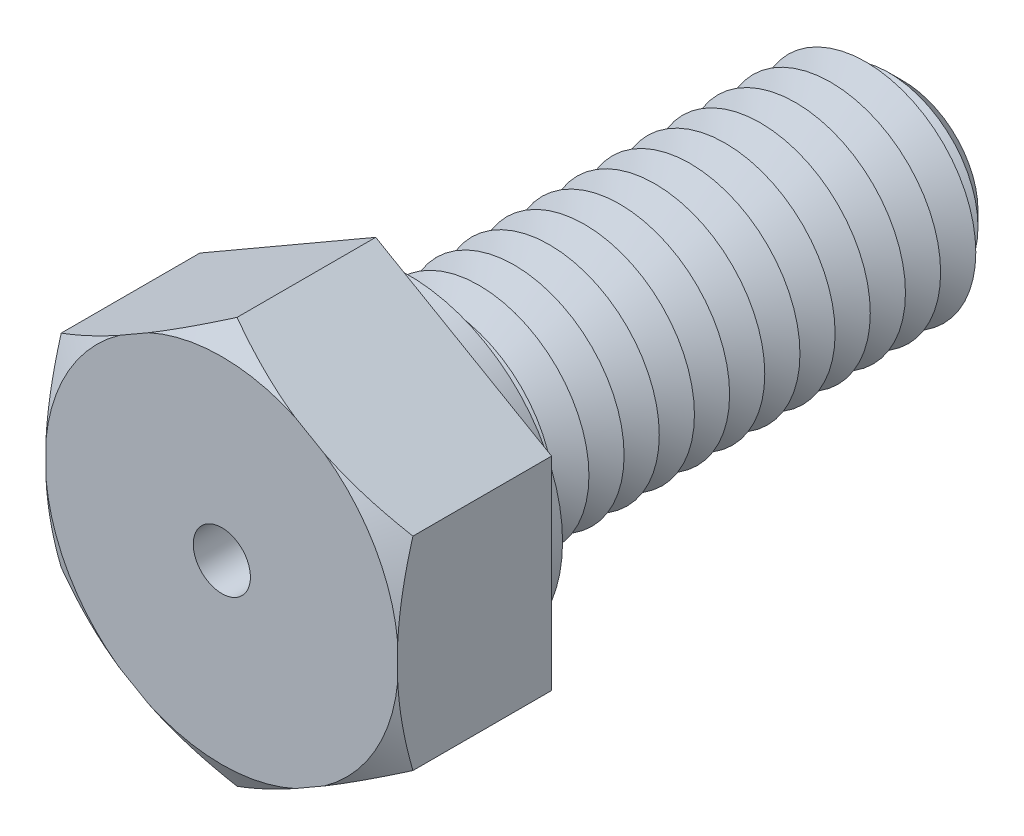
ISO-10303-21;
HEADER;
FILE_DESCRIPTION(('STEP AP214'),'2;1');
FILE_NAME('part.step','',(''),(''),'','','');
FILE_SCHEMA(('AUTOMOTIVE_DESIGN { 1 0 10303 214 1 1 1 1 }'));
ENDSEC;
DATA;
#1=APPLICATION_CONTEXT('core data for automotive mechanical design processes');
#2=APPLICATION_PROTOCOL_DEFINITION('international standard','automotive_design',2000,#1);
#3=PRODUCT_CONTEXT('',#1,'mechanical');
#4=PRODUCT('Part','Part','',(#3));
#5=PRODUCT_RELATED_PRODUCT_CATEGORY('part','',(#4));
#6=PRODUCT_DEFINITION_FORMATION('','',#4);
#7=PRODUCT_DEFINITION_CONTEXT('part definition',#1,'design');
#8=PRODUCT_DEFINITION('design','',#6,#7);
#9=PRODUCT_DEFINITION_SHAPE('','',#8);
#10=(LENGTH_UNIT() NAMED_UNIT(*) SI_UNIT(.MILLI.,.METRE.));
#11=(NAMED_UNIT(*) PLANE_ANGLE_UNIT() SI_UNIT($,.RADIAN.));
#12=(NAMED_UNIT(*) SI_UNIT($,.STERADIAN.) SOLID_ANGLE_UNIT());
#13=UNCERTAINTY_MEASURE_WITH_UNIT(LENGTH_MEASURE(1.E-05),#10,'distance_accuracy_value','');
#14=(GEOMETRIC_REPRESENTATION_CONTEXT(3) GLOBAL_UNCERTAINTY_ASSIGNED_CONTEXT((#13)) GLOBAL_UNIT_ASSIGNED_CONTEXT((#10,
#11,#12)) REPRESENTATION_CONTEXT('',''));
#15=CARTESIAN_POINT('',(0.,0.,0.));
#16=DIRECTION('',(0.,0.,1.));
#17=DIRECTION('',(1.,0.,0.));
#18=AXIS2_PLACEMENT_3D('',#15,#16,#17);
#19=CARTESIAN_POINT('',(4.,2.3094010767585,3.5));
#20=DIRECTION('',(-0.5,-0.866025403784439,0.));
#21=DIRECTION('',(0.866025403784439,-0.5,0.));
#22=AXIS2_PLACEMENT_3D('',#19,#20,#21);
#23=PLANE('',#22);
#24=CARTESIAN_POINT('',(6.77926459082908,0.704791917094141,1.88515125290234));
#25=CARTESIAN_POINT('',(6.65357706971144,0.777357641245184,1.95298106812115));
#26=CARTESIAN_POINT('',(6.52758896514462,0.850096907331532,2.02007962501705));
#27=CARTESIAN_POINT('',(6.2748848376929,0.995995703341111,2.15247084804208));
#28=CARTESIAN_POINT('',(6.14816872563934,1.06915528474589,2.21776328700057));
#29=CARTESIAN_POINT('',(5.8935057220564,1.21618503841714,2.34638757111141));
#30=CARTESIAN_POINT('',(5.76555618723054,1.29005673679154,2.40971246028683));
#31=CARTESIAN_POINT('',(5.50869902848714,1.43835328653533,2.53371033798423));
#32=CARTESIAN_POINT('',(5.37979143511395,1.51277812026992,2.59438341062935));
#33=CARTESIAN_POINT('',(5.11756014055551,1.66417742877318,2.7140043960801));
#34=CARTESIAN_POINT('',(4.98420771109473,1.74116848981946,2.77286873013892));
#35=CARTESIAN_POINT('',(4.7161724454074,1.89591872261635,2.88640197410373));
#36=CARTESIAN_POINT('',(4.58148968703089,1.97367784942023,2.94107112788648));
#37=CARTESIAN_POINT('',(4.31074083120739,2.12999477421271,3.0451841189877));
#38=CARTESIAN_POINT('',(4.17467611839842,2.20855177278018,3.09463271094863));
#39=CARTESIAN_POINT('',(3.90094921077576,2.36658807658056,3.18716064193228));
#40=CARTESIAN_POINT('',(3.76328722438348,2.44606726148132,3.23024080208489));
#41=CARTESIAN_POINT('',(3.43409497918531,2.63612649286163,3.32342391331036));
#42=CARTESIAN_POINT('',(3.24179802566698,2.74714919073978,3.37006382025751));
#43=CARTESIAN_POINT('',(2.95137883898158,2.91482278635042,3.4261412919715));
#44=CARTESIAN_POINT('',(2.85424512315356,2.97090296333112,3.44251989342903));
#45=CARTESIAN_POINT('',(2.65944416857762,3.08337134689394,3.47023794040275));
#46=CARTESIAN_POINT('',(2.56177700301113,3.13975951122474,3.48157806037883));
#47=CARTESIAN_POINT('',(2.36721602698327,3.25208934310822,3.49879538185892));
#48=CARTESIAN_POINT('',(2.27032632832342,3.30802863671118,3.50473421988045));
#49=CARTESIAN_POINT('',(2.07641108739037,3.41998565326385,3.51119583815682));
#50=CARTESIAN_POINT('',(1.97938554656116,3.47600337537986,3.51171867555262));
#51=CARTESIAN_POINT('',(1.78542763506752,3.58798502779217,3.50733170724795));
#52=CARTESIAN_POINT('',(1.68849526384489,3.64394895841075,3.50242193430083));
#53=CARTESIAN_POINT('',(1.49492986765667,3.75570399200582,3.48731840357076));
#54=CARTESIAN_POINT('',(1.39829689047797,3.81149506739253,3.47712384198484));
#55=CARTESIAN_POINT('',(1.1701117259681,3.94323783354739,3.44706969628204));
#56=CARTESIAN_POINT('',(1.03877271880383,4.01906644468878,3.42503535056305));
#57=CARTESIAN_POINT('',(0.777349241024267,4.16999935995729,3.37264454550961));
#58=CARTESIAN_POINT('',(0.64726495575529,4.24510355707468,3.34228687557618));
#59=CARTESIAN_POINT('',(0.388367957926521,4.3945778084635,3.27439527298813));
#60=CARTESIAN_POINT('',(0.259556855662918,4.46894693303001,3.2368532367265));
#61=CARTESIAN_POINT('',(0.00337956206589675,4.61685096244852,3.15577578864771));
#62=CARTESIAN_POINT('',(-0.123986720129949,4.69038591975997,3.11224075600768));
#63=CARTESIAN_POINT('',(-0.378873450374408,4.83754484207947,3.01966290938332));
#64=CARTESIAN_POINT('',(-0.506377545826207,4.91115936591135,2.97056048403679));
#65=CARTESIAN_POINT('',(-0.760034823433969,5.0576084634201,2.86822484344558));
#66=CARTESIAN_POINT('',(-0.886188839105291,5.13044351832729,2.81499436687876));
#67=CARTESIAN_POINT('',(-1.13734672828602,5.27544959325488,2.70513446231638));
#68=CARTESIAN_POINT('',(-1.26235083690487,5.34762074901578,2.6485057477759));
#69=CARTESIAN_POINT('',(-1.5113783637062,5.49139685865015,2.53244390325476));
#70=CARTESIAN_POINT('',(-1.63540176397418,5.56300180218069,2.47301072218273));
#71=CARTESIAN_POINT('',(-1.84520240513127,5.68413025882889,2.37015667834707));
#72=CARTESIAN_POINT('',(-1.93119941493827,5.73378065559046,2.32733101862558));
#73=CARTESIAN_POINT('',(-2.1028145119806,5.83286267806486,2.24068817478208));
#74=CARTESIAN_POINT('',(-2.18843261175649,5.88229431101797,2.19687102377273));
#75=CARTESIAN_POINT('',(-2.3584228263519,5.98043820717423,2.10883190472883));
#76=CARTESIAN_POINT('',(-2.44279852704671,6.02915254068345,2.06461915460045));
#77=CARTESIAN_POINT('',(-2.61124951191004,6.12640776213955,1.97543229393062));
#78=CARTESIAN_POINT('',(-2.6953247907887,6.17494864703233,1.93045817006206));
#79=CARTESIAN_POINT('',(-2.77926459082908,6.22341131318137,1.88515125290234));
#80=B_SPLINE_CURVE_WITH_KNOTS('',3,(#24,#25,#26,#27,#28,#29,#30,#31,#32,#33,#34,#35,#36,#37,#38,
#39,#40,#41,#42,#43,#44,#45,#46,#47,#48,#49,#50,#51,#52,#53,#54,#55,#56,#57,#58,#59,#60,#61,#62,
#63,#64,#65,#66,#67,#68,#69,#70,#71,#72,#73,#74,#75,#76,#77,#78,#79),.UNSPECIFIED.,.F.,.F.,(4,2,
2,2,2,2,2,2,2,2,2,2,2,2,2,2,2,2,2,2,2,2,2,2,2,2,2,4),(0.,0.480604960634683,0.96127009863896,
1.44347608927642,1.92566677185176,2.42016676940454,2.91463799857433,3.4086549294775,
3.9026081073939,4.58254272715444,4.92249867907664,5.26240911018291,5.59839013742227,
5.93436761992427,6.27034307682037,6.60636964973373,7.06584039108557,7.52537799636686,
7.98543702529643,8.44546695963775,8.91099531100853,9.37621741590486,9.84134218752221,
10.3064754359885,10.6308960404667,10.9553058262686,11.2762760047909,11.5972518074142),.UNSPECIFIED.);
#81=CARTESIAN_POINT('',(4.,2.3094010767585,3.15358983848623));
#82=VERTEX_POINT('',#81);
#83=CARTESIAN_POINT('',(2.33627081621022,3.26995556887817,3.5));
#84=VERTEX_POINT('',#83);
#85=EDGE_CURVE('E132',#82,#84,#80,.T.);
#86=ORIENTED_EDGE('',*,*,#85,.F.);
#87=DIRECTION('',(0.,0.,-1.));
#88=VECTOR('',#87,1.);
#89=CARTESIAN_POINT('',(4.,2.3094010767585,3.5));
#90=LINE('',#89,#88);
#91=CARTESIAN_POINT('',(4.,2.3094010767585,0.));
#92=VERTEX_POINT('',#91);
#93=EDGE_CURVE('E144',#82,#92,#90,.T.);
#94=ORIENTED_EDGE('',*,*,#93,.T.);
#95=DIRECTION('',(-0.866025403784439,0.5,0.));
#96=VECTOR('',#95,1.);
#97=CARTESIAN_POINT('',(4.,2.3094010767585,0.));
#98=LINE('',#97,#96);
#99=CARTESIAN_POINT('',(0.,4.618802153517,0.));
#100=VERTEX_POINT('',#99);
#101=EDGE_CURVE('E314',#92,#100,#98,.T.);
#102=ORIENTED_EDGE('',*,*,#101,.T.);
#103=DIRECTION('',(0.,0.,-1.));
#104=VECTOR('',#103,1.);
#105=CARTESIAN_POINT('',(0.,4.618802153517,3.5));
#106=LINE('',#105,#104);
#107=CARTESIAN_POINT('',(0.,4.61880215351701,3.15358983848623));
#108=VERTEX_POINT('',#107);
#109=EDGE_CURVE('E179',#108,#100,#106,.T.);
#110=ORIENTED_EDGE('',*,*,#109,.F.);
#111=CARTESIAN_POINT('',(1.66372918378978,3.65824766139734,3.5));
#112=VERTEX_POINT('',#111);
#113=EDGE_CURVE('E151',#112,#108,#80,.T.);
#114=ORIENTED_EDGE('',*,*,#113,.F.);
#115=DIRECTION('',(-0.866025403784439,0.5,0.));
#116=VECTOR('',#115,1.);
#117=CARTESIAN_POINT('',(4.,2.3094010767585,3.5));
#118=LINE('',#117,#116);
#119=EDGE_CURVE('E148',#84,#112,#118,.T.);
#120=ORIENTED_EDGE('',*,*,#119,.F.);
#121=EDGE_LOOP('',(#86,#94,#102,#110,#114,#120));
#122=FACE_BOUND('',#121,.T.);
#123=ADVANCED_FACE('F39',(#122),#23,.F.);
#124=CARTESIAN_POINT('',(0.,4.618802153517,3.5));
#125=DIRECTION('',(0.5,-0.866025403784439,0.));
#126=DIRECTION('',(0.866025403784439,0.5,0.));
#127=AXIS2_PLACEMENT_3D('',#124,#125,#126);
#128=PLANE('',#127);
#129=CARTESIAN_POINT('',(2.77926459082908,6.22341131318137,1.88515125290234));
#130=CARTESIAN_POINT('',(2.65357706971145,6.15084558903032,1.95298106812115));
#131=CARTESIAN_POINT('',(2.52758896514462,6.07810632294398,2.02007962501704));
#132=CARTESIAN_POINT('',(2.2748848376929,5.9322075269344,2.15247084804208));
#133=CARTESIAN_POINT('',(2.14816872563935,5.85904794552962,2.21776328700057));
#134=CARTESIAN_POINT('',(1.89350572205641,5.71201819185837,2.3463875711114));
#135=CARTESIAN_POINT('',(1.76555618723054,5.63814649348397,2.40971246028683));
#136=CARTESIAN_POINT('',(1.50869902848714,5.48984994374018,2.53371033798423));
#137=CARTESIAN_POINT('',(1.37979143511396,5.41542511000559,2.59438341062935));
#138=CARTESIAN_POINT('',(1.11756014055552,5.26402580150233,2.7140043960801));
#139=CARTESIAN_POINT('',(0.984207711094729,5.18703474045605,2.77286873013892));
#140=CARTESIAN_POINT('',(0.716172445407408,5.03228450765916,2.88640197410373));
#141=CARTESIAN_POINT('',(0.581489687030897,4.95452538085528,2.94107112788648));
#142=CARTESIAN_POINT('',(0.310740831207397,4.7982084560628,3.0451841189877));
#143=CARTESIAN_POINT('',(0.174676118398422,4.71965145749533,3.09463271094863));
#144=CARTESIAN_POINT('',(-0.0990507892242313,4.56161515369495,3.18716064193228));
#145=CARTESIAN_POINT('',(-0.236712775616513,4.48213596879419,3.23024080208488));
#146=CARTESIAN_POINT('',(-0.565905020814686,4.29207673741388,3.32342391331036));
#147=CARTESIAN_POINT('',(-0.758201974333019,4.18105403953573,3.37006382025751));
#148=CARTESIAN_POINT('',(-1.04862116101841,4.01338044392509,3.4261412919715));
#149=CARTESIAN_POINT('',(-1.14575487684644,3.95730026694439,3.44251989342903));
#150=CARTESIAN_POINT('',(-1.34055583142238,3.84483188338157,3.47023794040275));
#151=CARTESIAN_POINT('',(-1.43822299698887,3.78844371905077,3.48157806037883));
#152=CARTESIAN_POINT('',(-1.63278397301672,3.67611388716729,3.49879538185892));
#153=CARTESIAN_POINT('',(-1.72967367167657,3.62017459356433,3.50473421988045));
#154=CARTESIAN_POINT('',(-1.92358891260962,3.50821757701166,3.51119583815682));
#155=CARTESIAN_POINT('',(-2.02061445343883,3.45219985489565,3.51171867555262));
#156=CARTESIAN_POINT('',(-2.21457236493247,3.34021820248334,3.50733170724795));
#157=CARTESIAN_POINT('',(-2.3115047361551,3.28425427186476,3.50242193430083));
#158=CARTESIAN_POINT('',(-2.50507013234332,3.1724992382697,3.48731840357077));
#159=CARTESIAN_POINT('',(-2.60170310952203,3.11670816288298,3.47712384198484));
#160=CARTESIAN_POINT('',(-2.82988827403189,2.98496539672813,3.44706969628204));
#161=CARTESIAN_POINT('',(-2.96122728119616,2.90913678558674,3.42503535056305));
#162=CARTESIAN_POINT('',(-3.22265075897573,2.75820387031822,3.37264454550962));
#163=CARTESIAN_POINT('',(-3.3527350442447,2.68309967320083,3.34228687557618));
#164=CARTESIAN_POINT('',(-3.61163204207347,2.53362542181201,3.27439527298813));
#165=CARTESIAN_POINT('',(-3.74044314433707,2.4592562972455,3.23685323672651));
#166=CARTESIAN_POINT('',(-3.99662043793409,2.311352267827,3.15577578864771));
#167=CARTESIAN_POINT('',(-4.12398672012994,2.23781731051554,3.11224075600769));
#168=CARTESIAN_POINT('',(-4.3788734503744,2.09065838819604,3.01966290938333));
#169=CARTESIAN_POINT('',(-4.5063775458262,2.01704386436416,2.97056048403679));
#170=CARTESIAN_POINT('',(-4.76003482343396,1.87059476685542,2.86822484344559));
#171=CARTESIAN_POINT('',(-4.88618883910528,1.79775971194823,2.81499436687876));
#172=CARTESIAN_POINT('',(-5.13734672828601,1.65275363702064,2.70513446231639));
#173=CARTESIAN_POINT('',(-5.26235083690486,1.58058248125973,2.64850574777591));
#174=CARTESIAN_POINT('',(-5.51137836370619,1.43680637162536,2.53244390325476));
#175=CARTESIAN_POINT('',(-5.63540176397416,1.36520142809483,2.47301072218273));
#176=CARTESIAN_POINT('',(-5.84520240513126,1.24407297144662,2.37015667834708));
#177=CARTESIAN_POINT('',(-5.93119941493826,1.19442257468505,2.32733101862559));
#178=CARTESIAN_POINT('',(-6.1028145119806,1.09534055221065,2.24068817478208));
#179=CARTESIAN_POINT('',(-6.18843261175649,1.04590891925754,2.19687102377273));
#180=CARTESIAN_POINT('',(-6.3584228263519,0.947765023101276,2.10883190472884));
#181=CARTESIAN_POINT('',(-6.44279852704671,0.899050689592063,2.06461915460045));
#182=CARTESIAN_POINT('',(-6.61124951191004,0.80179546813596,1.97543229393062));
#183=CARTESIAN_POINT('',(-6.6953247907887,0.753254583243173,1.93045817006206));
#184=CARTESIAN_POINT('',(-6.77926459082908,0.704791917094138,1.88515125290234));
#185=B_SPLINE_CURVE_WITH_KNOTS('',3,(#129,#130,#131,#132,#133,#134,#135,#136,#137,#138,#139,
#140,#141,#142,#143,#144,#145,#146,#147,#148,#149,#150,#151,#152,#153,#154,#155,#156,#157,#158,
#159,#160,#161,#162,#163,#164,#165,#166,#167,#168,#169,#170,#171,#172,#173,#174,#175,#176,#177,
#178,#179,#180,#181,#182,#183,#184),.UNSPECIFIED.,.F.,.F.,(4,2,2,2,2,2,2,2,2,2,2,2,2,2,2,2,2,2,
2,2,2,2,2,2,2,2,2,4),(0.,0.480604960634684,0.961270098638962,1.44347608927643,1.92566677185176,
2.42016676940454,2.91463799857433,3.4086549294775,3.9026081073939,4.58254272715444,
4.92249867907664,5.26240911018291,5.59839013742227,5.93436761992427,6.27034307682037,
6.60636964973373,7.06584039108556,7.52537799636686,7.98543702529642,8.44546695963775,
8.91099531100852,9.37621741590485,9.8413421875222,10.3064754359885,10.6308960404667,
10.9553058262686,11.2762760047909,11.5972518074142),.UNSPECIFIED.);
#186=CARTESIAN_POINT('',(-1.66372918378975,3.65824766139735,3.5));
#187=VERTEX_POINT('',#186);
#188=EDGE_CURVE('E929',#108,#187,#185,.T.);
#189=ORIENTED_EDGE('',*,*,#188,.F.);
#190=ORIENTED_EDGE('',*,*,#109,.T.);
#191=DIRECTION('',(-0.866025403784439,-0.5,0.));
#192=VECTOR('',#191,1.);
#193=CARTESIAN_POINT('',(0.,4.618802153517,0.));
#194=LINE('',#193,#192);
#195=CARTESIAN_POINT('',(-4.,2.3094010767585,0.));
#196=VERTEX_POINT('',#195);
#197=EDGE_CURVE('E334',#100,#196,#194,.T.);
#198=ORIENTED_EDGE('',*,*,#197,.T.);
#199=DIRECTION('',(0.,0.,-1.));
#200=VECTOR('',#199,1.);
#201=CARTESIAN_POINT('',(-4.,2.3094010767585,3.5));
#202=LINE('',#201,#200);
#203=CARTESIAN_POINT('',(-4.,2.3094010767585,3.15358983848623));
#204=VERTEX_POINT('',#203);
#205=EDGE_CURVE('E176',#204,#196,#202,.T.);
#206=ORIENTED_EDGE('',*,*,#205,.F.);
#207=CARTESIAN_POINT('',(-2.33627081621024,3.26995556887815,3.5));
#208=VERTEX_POINT('',#207);
#209=EDGE_CURVE('E355',#208,#204,#185,.T.);
#210=ORIENTED_EDGE('',*,*,#209,.F.);
#211=DIRECTION('',(-0.866025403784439,-0.5,0.));
#212=VECTOR('',#211,1.);
#213=CARTESIAN_POINT('',(0.,4.618802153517,3.5));
#214=LINE('',#213,#212);
#215=EDGE_CURVE('E317',#187,#208,#214,.T.);
#216=ORIENTED_EDGE('',*,*,#215,.F.);
#217=EDGE_LOOP('',(#189,#190,#198,#206,#210,#216));
#218=FACE_BOUND('',#217,.T.);
#219=ADVANCED_FACE('F417',(#218),#128,.F.);
#220=CARTESIAN_POINT('',(-4.,2.3094010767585,3.5));
#221=DIRECTION('',(1.,0.,0.));
#222=DIRECTION('',(0.,0.,-1.));
#223=AXIS2_PLACEMENT_3D('',#220,#221,#222);
#224=PLANE('',#223);
#225=CARTESIAN_POINT('',(-4.,5.08866566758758,2.08330060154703));
#226=CARTESIAN_POINT('',(-4.,4.94414615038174,2.14888120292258));
#227=CARTESIAN_POINT('',(-4.,4.79923170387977,2.21360759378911));
#228=CARTESIAN_POINT('',(-4.,4.5084433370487,2.34093771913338));
#229=CARTESIAN_POINT('',(-4.,4.36256924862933,2.4035410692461));
#230=CARTESIAN_POINT('',(-4.,4.06913305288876,2.52644280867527));
#231=CARTESIAN_POINT('',(-4.,3.92156644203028,2.58673049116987));
#232=CARTESIAN_POINT('',(-4.,3.62518774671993,2.70415001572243));
#233=CARTESIAN_POINT('',(-4.,3.47637571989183,2.76128200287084));
#234=CARTESIAN_POINT('',(-4.,3.17798204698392,2.87144502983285));
#235=CARTESIAN_POINT('',(-4.,3.02840679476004,2.92449322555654));
#236=CARTESIAN_POINT('',(-4.,2.72767549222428,3.02589725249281));
#237=CARTESIAN_POINT('',(-4.,2.57651933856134,3.07425277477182));
#238=CARTESIAN_POINT('',(-4.,2.12084922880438,3.21062944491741));
#239=CARTESIAN_POINT('',(-4.,1.81364350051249,3.29014850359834));
#240=CARTESIAN_POINT('',(-4.,1.28033133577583,3.39840613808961));
#241=CARTESIAN_POINT('',(-4.,1.05588972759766,3.43514774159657));
#242=CARTESIAN_POINT('',(-4.,0.717455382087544,3.47487260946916));
#243=CARTESIAN_POINT('',(-4.,0.604348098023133,3.48554965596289));
#244=CARTESIAN_POINT('',(-4.,0.377758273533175,3.50148677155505));
#245=CARTESIAN_POINT('',(-4.,0.264275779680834,3.50674748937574));
#246=CARTESIAN_POINT('',(-4.,0.0372413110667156,3.51168400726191));
#247=CARTESIAN_POINT('',(-4.,-0.0763106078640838,3.51136237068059));
#248=CARTESIAN_POINT('',(-4.,-0.303259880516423,3.50515259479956));
#249=CARTESIAN_POINT('',(-4.,-0.416657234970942,3.49926448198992));
#250=CARTESIAN_POINT('',(-4.,-0.643045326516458,3.48210091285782));
#251=CARTESIAN_POINT('',(-4.,-0.756036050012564,3.47082527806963));
#252=CARTESIAN_POINT('',(-4.,-0.981405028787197,3.44321260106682));
#253=CARTESIAN_POINT('',(-4.,-1.09378317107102,3.42687465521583));
#254=CARTESIAN_POINT('',(-4.,-1.54188975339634,3.35219605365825));
#255=CARTESIAN_POINT('',(-4.,-1.87460189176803,3.27522286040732));
#256=CARTESIAN_POINT('',(-4.,-2.36751874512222,3.1379521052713));
#257=CARTESIAN_POINT('',(-4.,-2.53101356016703,3.08847923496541));
#258=CARTESIAN_POINT('',(-4.,-2.85611626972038,2.98363580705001));
#259=CARTESIAN_POINT('',(-4.,-3.01772429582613,2.92826566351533));
#260=CARTESIAN_POINT('',(-4.,-3.34106601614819,2.81212836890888));
#261=CARTESIAN_POINT('',(-4.,-3.50277978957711,2.75130648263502));
#262=CARTESIAN_POINT('',(-4.,-3.82469686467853,2.62576992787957));
#263=CARTESIAN_POINT('',(-4.,-3.98490007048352,2.56105501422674));
#264=CARTESIAN_POINT('',(-4.,-4.30300593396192,2.4289095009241));
#265=CARTESIAN_POINT('',(-4.,-4.46091670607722,2.36149833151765));
#266=CARTESIAN_POINT('',(-4.,-4.7755935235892,2.22415533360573));
#267=CARTESIAN_POINT('',(-4.,-4.93235984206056,2.15422413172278));
#268=CARTESIAN_POINT('',(-4.,-5.08866566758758,2.08330060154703));
#269=B_SPLINE_CURVE_WITH_KNOTS('',3,(#225,#226,#227,#228,#229,#230,#231,#232,#233,#234,#235,
#236,#237,#238,#239,#240,#241,#242,#243,#244,#245,#246,#247,#248,#249,#250,#251,#252,#253,#254,
#255,#256,#257,#258,#259,#260,#261,#262,#263,#264,#265,#266,#267,#268),.UNSPECIFIED.,.F.,.F.,(4,
2,2,2,2,2,2,2,2,2,2,2,2,2,2,2,2,2,2,2,2,4),(0.,0.476116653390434,0.952319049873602,
1.43050831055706,1.90867556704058,2.38470991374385,2.8607755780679,3.81133518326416,
4.49276221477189,4.83347879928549,5.17415457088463,5.51467391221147,5.85519163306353,
6.19572063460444,6.53631045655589,7.5583874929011,8.07079781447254,8.58317218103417,
9.1014378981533,9.61973628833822,10.1348057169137,10.6497479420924),.UNSPECIFIED.);
#270=CARTESIAN_POINT('',(-4.,0.388292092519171,3.5));
#271=VERTEX_POINT('',#270);
#272=EDGE_CURVE('E354',#204,#271,#269,.T.);
#273=ORIENTED_EDGE('',*,*,#272,.F.);
#274=ORIENTED_EDGE('',*,*,#205,.T.);
#275=DIRECTION('',(0.,-1.,0.));
#276=VECTOR('',#275,1.);
#277=CARTESIAN_POINT('',(-4.,2.3094010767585,0.));
#278=LINE('',#277,#276);
#279=CARTESIAN_POINT('',(-4.,-2.3094010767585,0.));
#280=VERTEX_POINT('',#279);
#281=EDGE_CURVE('E338',#196,#280,#278,.T.);
#282=ORIENTED_EDGE('',*,*,#281,.T.);
#283=DIRECTION('',(0.,0.,-1.));
#284=VECTOR('',#283,1.);
#285=CARTESIAN_POINT('',(-4.,-2.3094010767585,3.5));
#286=LINE('',#285,#284);
#287=CARTESIAN_POINT('',(-4.,-2.30940107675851,3.15358983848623));
#288=VERTEX_POINT('',#287);
#289=EDGE_CURVE('E173',#288,#280,#286,.T.);
#290=ORIENTED_EDGE('',*,*,#289,.F.);
#291=CARTESIAN_POINT('',(-4.,-0.388292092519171,3.5));
#292=VERTEX_POINT('',#291);
#293=EDGE_CURVE('E356',#292,#288,#269,.T.);
#294=ORIENTED_EDGE('',*,*,#293,.F.);
#295=DIRECTION('',(0.,-1.,0.));
#296=VECTOR('',#295,1.);
#297=CARTESIAN_POINT('',(-4.,2.3094010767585,3.5));
#298=LINE('',#297,#296);
#299=EDGE_CURVE('E321',#271,#292,#298,.T.);
#300=ORIENTED_EDGE('',*,*,#299,.F.);
#301=EDGE_LOOP('',(#273,#274,#282,#290,#294,#300));
#302=FACE_BOUND('',#301,.T.);
#303=ADVANCED_FACE('F413',(#302),#224,.F.);
#304=CARTESIAN_POINT('',(-4.,-2.3094010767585,3.5));
#305=DIRECTION('',(0.5,0.866025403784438,0.));
#306=DIRECTION('',(-0.866025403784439,0.5,0.));
#307=AXIS2_PLACEMENT_3D('',#304,#305,#306);
#308=PLANE('',#307);
#309=CARTESIAN_POINT('',(-6.77926459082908,-0.704791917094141,1.88515125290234));
#310=CARTESIAN_POINT('',(-6.65357706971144,-0.777357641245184,1.95298106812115));
#311=CARTESIAN_POINT('',(-6.52758896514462,-0.850096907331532,2.02007962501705));
#312=CARTESIAN_POINT('',(-6.2748848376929,-0.995995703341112,2.15247084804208));
#313=CARTESIAN_POINT('',(-6.14816872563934,-1.06915528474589,2.21776328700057));
#314=CARTESIAN_POINT('',(-5.8935057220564,-1.21618503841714,2.34638757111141));
#315=CARTESIAN_POINT('',(-5.76555618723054,-1.29005673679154,2.40971246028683));
#316=CARTESIAN_POINT('',(-5.50869902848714,-1.43835328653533,2.53371033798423));
#317=CARTESIAN_POINT('',(-5.37979143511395,-1.51277812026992,2.59438341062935));
#318=CARTESIAN_POINT('',(-5.11756014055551,-1.66417742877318,2.71400439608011));
#319=CARTESIAN_POINT('',(-4.98420771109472,-1.74116848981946,2.77286873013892));
#320=CARTESIAN_POINT('',(-4.7161724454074,-1.89591872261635,2.88640197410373));
#321=CARTESIAN_POINT('',(-4.58148968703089,-1.97367784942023,2.94107112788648));
#322=CARTESIAN_POINT('',(-4.31074083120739,-2.12999477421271,3.0451841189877));
#323=CARTESIAN_POINT('',(-4.17467611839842,-2.20855177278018,3.09463271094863));
#324=CARTESIAN_POINT('',(-3.90094921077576,-2.36658807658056,3.18716064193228));
#325=CARTESIAN_POINT('',(-3.76328722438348,-2.44606726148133,3.23024080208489));
#326=CARTESIAN_POINT('',(-3.43409497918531,-2.63612649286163,3.32342391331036));
#327=CARTESIAN_POINT('',(-3.24179802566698,-2.74714919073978,3.3700638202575));
#328=CARTESIAN_POINT('',(-2.95137883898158,-2.91482278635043,3.4261412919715));
#329=CARTESIAN_POINT('',(-2.85424512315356,-2.97090296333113,3.44251989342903));
#330=CARTESIAN_POINT('',(-2.65944416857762,-3.08337134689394,3.47023794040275));
#331=CARTESIAN_POINT('',(-2.56177700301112,-3.13975951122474,3.48157806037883));
#332=CARTESIAN_POINT('',(-2.36721602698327,-3.25208934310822,3.49879538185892));
#333=CARTESIAN_POINT('',(-2.27032632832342,-3.30802863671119,3.50473421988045));
#334=CARTESIAN_POINT('',(-2.07641108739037,-3.41998565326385,3.51119583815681));
#335=CARTESIAN_POINT('',(-1.97938554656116,-3.47600337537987,3.51171867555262));
#336=CARTESIAN_POINT('',(-1.78542763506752,-3.58798502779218,3.50733170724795));
#337=CARTESIAN_POINT('',(-1.68849526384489,-3.64394895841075,3.50242193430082));
#338=CARTESIAN_POINT('',(-1.49492986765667,-3.75570399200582,3.48731840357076));
#339=CARTESIAN_POINT('',(-1.39829689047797,-3.81149506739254,3.47712384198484));
#340=CARTESIAN_POINT('',(-1.1701117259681,-3.94323783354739,3.44706969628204));
#341=CARTESIAN_POINT('',(-1.03877271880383,-4.01906644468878,3.42503535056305));
#342=CARTESIAN_POINT('',(-0.777349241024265,-4.1699993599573,3.37264454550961));
#343=CARTESIAN_POINT('',(-0.647264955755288,-4.24510355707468,3.34228687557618));
#344=CARTESIAN_POINT('',(-0.388367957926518,-4.39457780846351,3.27439527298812));
#345=CARTESIAN_POINT('',(-0.259556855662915,-4.46894693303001,3.2368532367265));
#346=CARTESIAN_POINT('',(-0.00337956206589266,-4.61685096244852,3.1557757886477));
#347=CARTESIAN_POINT('',(0.123986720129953,-4.69038591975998,3.11224075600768));
#348=CARTESIAN_POINT('',(0.378873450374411,-4.83754484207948,3.01966290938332));
#349=CARTESIAN_POINT('',(0.50637754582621,-4.91115936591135,2.97056048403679));
#350=CARTESIAN_POINT('',(0.760034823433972,-5.0576084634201,2.86822484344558));
#351=CARTESIAN_POINT('',(0.886188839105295,-5.13044351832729,2.81499436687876));
#352=CARTESIAN_POINT('',(1.13734672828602,-5.27544959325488,2.70513446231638));
#353=CARTESIAN_POINT('',(1.26235083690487,-5.34762074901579,2.6485057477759));
#354=CARTESIAN_POINT('',(1.5113783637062,-5.49139685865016,2.53244390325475));
#355=CARTESIAN_POINT('',(1.63540176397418,-5.56300180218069,2.47301072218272));
#356=CARTESIAN_POINT('',(1.84520240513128,-5.6841302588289,2.37015667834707));
#357=CARTESIAN_POINT('',(1.93119941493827,-5.73378065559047,2.32733101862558));
#358=CARTESIAN_POINT('',(2.10281451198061,-5.83286267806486,2.24068817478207));
#359=CARTESIAN_POINT('',(2.1884326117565,-5.88229431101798,2.19687102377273));
#360=CARTESIAN_POINT('',(2.3584228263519,-5.98043820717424,2.10883190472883));
#361=CARTESIAN_POINT('',(2.44279852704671,-6.02915254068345,2.06461915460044));
#362=CARTESIAN_POINT('',(2.61124951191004,-6.12640776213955,1.97543229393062));
#363=CARTESIAN_POINT('',(2.6953247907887,-6.17494864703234,1.93045817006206));
#364=CARTESIAN_POINT('',(2.77926459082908,-6.22341131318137,1.88515125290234));
#365=B_SPLINE_CURVE_WITH_KNOTS('',3,(#309,#310,#311,#312,#313,#314,#315,#316,#317,#318,#319,
#320,#321,#322,#323,#324,#325,#326,#327,#328,#329,#330,#331,#332,#333,#334,#335,#336,#337,#338,
#339,#340,#341,#342,#343,#344,#345,#346,#347,#348,#349,#350,#351,#352,#353,#354,#355,#356,#357,
#358,#359,#360,#361,#362,#363,#364),.UNSPECIFIED.,.F.,.F.,(4,2,2,2,2,2,2,2,2,2,2,2,2,2,2,2,2,2,
2,2,2,2,2,2,2,2,2,4),(0.,0.480604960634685,0.961270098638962,1.44347608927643,1.92566677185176,
2.42016676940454,2.91463799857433,3.4086549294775,3.90260810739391,4.58254272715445,
4.92249867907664,5.26240911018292,5.59839013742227,5.93436761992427,6.27034307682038,
6.60636964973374,7.06584039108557,7.52537799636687,7.98543702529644,8.44546695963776,
8.91099531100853,9.37621741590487,9.84134218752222,10.3064754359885,10.6308960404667,
10.9553058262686,11.2762760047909,11.5972518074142),.UNSPECIFIED.);
#366=CARTESIAN_POINT('',(-2.3362708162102,-3.26995556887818,3.5));
#367=VERTEX_POINT('',#366);
#368=EDGE_CURVE('E359',#288,#367,#365,.T.);
#369=ORIENTED_EDGE('',*,*,#368,.F.);
#370=ORIENTED_EDGE('',*,*,#289,.T.);
#371=DIRECTION('',(0.866025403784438,-0.5,0.));
#372=VECTOR('',#371,1.);
#373=CARTESIAN_POINT('',(-4.,-2.3094010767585,0.));
#374=LINE('',#373,#372);
#375=CARTESIAN_POINT('',(0.,-4.61880215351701,0.));
#376=VERTEX_POINT('',#375);
#377=EDGE_CURVE('E342',#280,#376,#374,.T.);
#378=ORIENTED_EDGE('',*,*,#377,.T.);
#379=DIRECTION('',(0.,0.,-1.));
#380=VECTOR('',#379,1.);
#381=CARTESIAN_POINT('',(0.,-4.61880215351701,3.5));
#382=LINE('',#381,#380);
#383=CARTESIAN_POINT('',(0.,-4.618802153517,3.15358983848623));
#384=VERTEX_POINT('',#383);
#385=EDGE_CURVE('E163',#384,#376,#382,.T.);
#386=ORIENTED_EDGE('',*,*,#385,.F.);
#387=CARTESIAN_POINT('',(-1.6637291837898,-3.65824766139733,3.5));
#388=VERTEX_POINT('',#387);
#389=EDGE_CURVE('E400',#388,#384,#365,.T.);
#390=ORIENTED_EDGE('',*,*,#389,.F.);
#391=DIRECTION('',(0.866025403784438,-0.5,0.));
#392=VECTOR('',#391,1.);
#393=CARTESIAN_POINT('',(-4.,-2.3094010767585,3.5));
#394=LINE('',#393,#392);
#395=EDGE_CURVE('E325',#367,#388,#394,.T.);
#396=ORIENTED_EDGE('',*,*,#395,.F.);
#397=EDGE_LOOP('',(#369,#370,#378,#386,#390,#396));
#398=FACE_BOUND('',#397,.T.);
#399=ADVANCED_FACE('F416',(#398),#308,.F.);
#400=CARTESIAN_POINT('',(0.,-4.61880215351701,3.5));
#401=DIRECTION('',(-0.5,0.866025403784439,0.));
#402=DIRECTION('',(-0.866025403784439,-0.5,0.));
#403=AXIS2_PLACEMENT_3D('',#400,#401,#402);
#404=PLANE('',#403);
#405=CARTESIAN_POINT('',(-2.77926459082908,-6.22341131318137,1.88515125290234));
#406=CARTESIAN_POINT('',(-2.65357706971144,-6.15084558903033,1.95298106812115));
#407=CARTESIAN_POINT('',(-2.52758896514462,-6.07810632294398,2.02007962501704));
#408=CARTESIAN_POINT('',(-2.2748848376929,-5.9322075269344,2.15247084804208));
#409=CARTESIAN_POINT('',(-2.14816872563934,-5.85904794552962,2.21776328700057));
#410=CARTESIAN_POINT('',(-1.8935057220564,-5.71201819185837,2.3463875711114));
#411=CARTESIAN_POINT('',(-1.76555618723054,-5.63814649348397,2.40971246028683));
#412=CARTESIAN_POINT('',(-1.50869902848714,-5.48984994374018,2.53371033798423));
#413=CARTESIAN_POINT('',(-1.37979143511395,-5.41542511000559,2.59438341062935));
#414=CARTESIAN_POINT('',(-1.11756014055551,-5.26402580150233,2.7140043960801));
#415=CARTESIAN_POINT('',(-0.984207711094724,-5.18703474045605,2.77286873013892));
#416=CARTESIAN_POINT('',(-0.716172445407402,-5.03228450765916,2.88640197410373));
#417=CARTESIAN_POINT('',(-0.581489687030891,-4.95452538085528,2.94107112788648));
#418=CARTESIAN_POINT('',(-0.310740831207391,-4.7982084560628,3.0451841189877));
#419=CARTESIAN_POINT('',(-0.174676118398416,-4.71965145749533,3.09463271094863));
#420=CARTESIAN_POINT('',(0.0990507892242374,-4.56161515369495,3.18716064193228));
#421=CARTESIAN_POINT('',(0.236712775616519,-4.48213596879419,3.23024080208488));
#422=CARTESIAN_POINT('',(0.565905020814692,-4.29207673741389,3.32342391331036));
#423=CARTESIAN_POINT('',(0.758201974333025,-4.18105403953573,3.37006382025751));
#424=CARTESIAN_POINT('',(1.04862116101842,-4.01338044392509,3.4261412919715));
#425=CARTESIAN_POINT('',(1.14575487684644,-3.95730026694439,3.44251989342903));
#426=CARTESIAN_POINT('',(1.34055583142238,-3.84483188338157,3.47023794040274));
#427=CARTESIAN_POINT('',(1.43822299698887,-3.78844371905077,3.48157806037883));
#428=CARTESIAN_POINT('',(1.63278397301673,-3.67611388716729,3.49879538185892));
#429=CARTESIAN_POINT('',(1.72967367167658,-3.62017459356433,3.50473421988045));
#430=CARTESIAN_POINT('',(1.92358891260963,-3.50821757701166,3.51119583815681));
#431=CARTESIAN_POINT('',(2.02061445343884,-3.45219985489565,3.51171867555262));
#432=CARTESIAN_POINT('',(2.21457236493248,-3.34021820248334,3.50733170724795));
#433=CARTESIAN_POINT('',(2.31150473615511,-3.28425427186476,3.50242193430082));
#434=CARTESIAN_POINT('',(2.50507013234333,-3.1724992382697,3.48731840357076));
#435=CARTESIAN_POINT('',(2.60170310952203,-3.11670816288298,3.47712384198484));
#436=CARTESIAN_POINT('',(2.8298882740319,-2.98496539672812,3.44706969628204));
#437=CARTESIAN_POINT('',(2.96122728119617,-2.90913678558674,3.42503535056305));
#438=CARTESIAN_POINT('',(3.22265075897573,-2.75820387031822,3.37264454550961));
#439=CARTESIAN_POINT('',(3.35273504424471,-2.68309967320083,3.34228687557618));
#440=CARTESIAN_POINT('',(3.61163204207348,-2.53362542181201,3.27439527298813));
#441=CARTESIAN_POINT('',(3.74044314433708,-2.4592562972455,3.2368532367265));
#442=CARTESIAN_POINT('',(3.99662043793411,-2.31135226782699,3.15577578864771));
#443=CARTESIAN_POINT('',(4.12398672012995,-2.23781731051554,3.11224075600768));
#444=CARTESIAN_POINT('',(4.37887345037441,-2.09065838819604,3.01966290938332));
#445=CARTESIAN_POINT('',(4.50637754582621,-2.01704386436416,2.97056048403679));
#446=CARTESIAN_POINT('',(4.76003482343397,-1.87059476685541,2.86822484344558));
#447=CARTESIAN_POINT('',(4.8861888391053,-1.79775971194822,2.81499436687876));
#448=CARTESIAN_POINT('',(5.13734672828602,-1.65275363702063,2.70513446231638));
#449=CARTESIAN_POINT('',(5.26235083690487,-1.58058248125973,2.6485057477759));
#450=CARTESIAN_POINT('',(5.5113783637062,-1.43680637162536,2.53244390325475));
#451=CARTESIAN_POINT('',(5.63540176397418,-1.36520142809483,2.47301072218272));
#452=CARTESIAN_POINT('',(5.84520240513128,-1.24407297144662,2.37015667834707));
#453=CARTESIAN_POINT('',(5.93119941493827,-1.19442257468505,2.32733101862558));
#454=CARTESIAN_POINT('',(6.1028145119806,-1.09534055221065,2.24068817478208));
#455=CARTESIAN_POINT('',(6.1884326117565,-1.04590891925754,2.19687102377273));
#456=CARTESIAN_POINT('',(6.3584228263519,-0.947765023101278,2.10883190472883));
#457=CARTESIAN_POINT('',(6.44279852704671,-0.899050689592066,2.06461915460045));
#458=CARTESIAN_POINT('',(6.61124951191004,-0.801795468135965,1.97543229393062));
#459=CARTESIAN_POINT('',(6.6953247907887,-0.753254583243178,1.93045817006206));
#460=CARTESIAN_POINT('',(6.77926459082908,-0.704791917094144,1.88515125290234));
#461=B_SPLINE_CURVE_WITH_KNOTS('',3,(#405,#406,#407,#408,#409,#410,#411,#412,#413,#414,#415,
#416,#417,#418,#419,#420,#421,#422,#423,#424,#425,#426,#427,#428,#429,#430,#431,#432,#433,#434,
#435,#436,#437,#438,#439,#440,#441,#442,#443,#444,#445,#446,#447,#448,#449,#450,#451,#452,#453,
#454,#455,#456,#457,#458,#459,#460),.UNSPECIFIED.,.F.,.F.,(4,2,2,2,2,2,2,2,2,2,2,2,2,2,2,2,2,2,
2,2,2,2,2,2,2,2,2,4),(0.,0.480604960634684,0.961270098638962,1.44347608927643,1.92566677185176,
2.42016676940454,2.91463799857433,3.4086549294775,3.90260810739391,4.58254272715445,
4.92249867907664,5.26240911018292,5.59839013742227,5.93436761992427,6.27034307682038,
6.60636964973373,7.06584039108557,7.52537799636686,7.98543702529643,8.44546695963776,
8.91099531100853,9.37621741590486,9.84134218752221,10.3064754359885,10.6308960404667,
10.9553058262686,11.2762760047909,11.5972518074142),.UNSPECIFIED.);
#462=CARTESIAN_POINT('',(1.6637291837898,-3.65824766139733,3.5));
#463=VERTEX_POINT('',#462);
#464=EDGE_CURVE('E64',#384,#463,#461,.T.);
#465=ORIENTED_EDGE('',*,*,#464,.F.);
#466=ORIENTED_EDGE('',*,*,#385,.T.);
#467=DIRECTION('',(0.866025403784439,0.5,0.));
#468=VECTOR('',#467,1.);
#469=CARTESIAN_POINT('',(0.,-4.61880215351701,0.));
#470=LINE('',#469,#468);
#471=CARTESIAN_POINT('',(4.,-2.30940107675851,0.));
#472=VERTEX_POINT('',#471);
#473=EDGE_CURVE('E345',#376,#472,#470,.T.);
#474=ORIENTED_EDGE('',*,*,#473,.T.);
#475=DIRECTION('',(0.,0.,-1.));
#476=VECTOR('',#475,1.);
#477=CARTESIAN_POINT('',(4.,-2.30940107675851,3.5));
#478=LINE('',#477,#476);
#479=CARTESIAN_POINT('',(4.,-2.3094010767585,3.15358983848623));
#480=VERTEX_POINT('',#479);
#481=EDGE_CURVE('E157',#480,#472,#478,.T.);
#482=ORIENTED_EDGE('',*,*,#481,.F.);
#483=CARTESIAN_POINT('',(2.3362708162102,-3.26995556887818,3.5));
#484=VERTEX_POINT('',#483);
#485=EDGE_CURVE('E395',#484,#480,#461,.T.);
#486=ORIENTED_EDGE('',*,*,#485,.F.);
#487=DIRECTION('',(0.866025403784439,0.5,0.));
#488=VECTOR('',#487,1.);
#489=CARTESIAN_POINT('',(0.,-4.61880215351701,3.5));
#490=LINE('',#489,#488);
#491=EDGE_CURVE('E166',#463,#484,#490,.T.);
#492=ORIENTED_EDGE('',*,*,#491,.F.);
#493=EDGE_LOOP('',(#465,#466,#474,#482,#486,#492));
#494=FACE_BOUND('',#493,.T.);
#495=ADVANCED_FACE('F438',(#494),#404,.F.);
#496=CARTESIAN_POINT('',(4.,-2.30940107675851,3.5));
#497=DIRECTION('',(-1.,0.,0.));
#498=DIRECTION('',(0.,0.,1.));
#499=AXIS2_PLACEMENT_3D('',#496,#497,#498);
#500=PLANE('',#499);
#501=CARTESIAN_POINT('',(4.,-5.08866566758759,2.08330060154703));
#502=CARTESIAN_POINT('',(4.,-4.94414615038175,2.14888120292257));
#503=CARTESIAN_POINT('',(4.,-4.79923170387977,2.21360759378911));
#504=CARTESIAN_POINT('',(4.,-4.50844333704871,2.34093771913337));
#505=CARTESIAN_POINT('',(4.,-4.36256924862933,2.40354106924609));
#506=CARTESIAN_POINT('',(4.,-4.06913305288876,2.52644280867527));
#507=CARTESIAN_POINT('',(4.,-3.92156644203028,2.58673049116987));
#508=CARTESIAN_POINT('',(4.,-3.62518774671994,2.70415001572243));
#509=CARTESIAN_POINT('',(4.,-3.47637571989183,2.76128200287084));
#510=CARTESIAN_POINT('',(4.,-3.17798204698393,2.87144502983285));
#511=CARTESIAN_POINT('',(4.,-3.02840679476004,2.92449322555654));
#512=CARTESIAN_POINT('',(4.,-2.72767549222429,3.02589725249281));
#513=CARTESIAN_POINT('',(4.,-2.57651933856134,3.07425277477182));
#514=CARTESIAN_POINT('',(4.,-2.12084922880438,3.21062944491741));
#515=CARTESIAN_POINT('',(4.,-1.8136435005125,3.29014850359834));
#516=CARTESIAN_POINT('',(4.,-1.28033133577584,3.39840613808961));
#517=CARTESIAN_POINT('',(4.,-1.05588972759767,3.43514774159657));
#518=CARTESIAN_POINT('',(4.,-0.71745538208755,3.47487260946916));
#519=CARTESIAN_POINT('',(4.,-0.604348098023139,3.48554965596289));
#520=CARTESIAN_POINT('',(4.,-0.377758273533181,3.50148677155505));
#521=CARTESIAN_POINT('',(4.,-0.264275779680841,3.50674748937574));
#522=CARTESIAN_POINT('',(4.,-0.0372413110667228,3.51168400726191));
#523=CARTESIAN_POINT('',(4.,0.0763106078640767,3.51136237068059));
#524=CARTESIAN_POINT('',(4.,0.303259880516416,3.50515259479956));
#525=CARTESIAN_POINT('',(4.,0.416657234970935,3.49926448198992));
#526=CARTESIAN_POINT('',(4.,0.643045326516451,3.48210091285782));
#527=CARTESIAN_POINT('',(4.,0.756036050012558,3.47082527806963));
#528=CARTESIAN_POINT('',(4.,0.98140502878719,3.44321260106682));
#529=CARTESIAN_POINT('',(4.,1.09378317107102,3.42687465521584));
#530=CARTESIAN_POINT('',(4.,1.54188975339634,3.35219605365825));
#531=CARTESIAN_POINT('',(4.,1.87460189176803,3.27522286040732));
#532=CARTESIAN_POINT('',(4.,2.36751874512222,3.1379521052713));
#533=CARTESIAN_POINT('',(4.,2.53101356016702,3.08847923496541));
#534=CARTESIAN_POINT('',(4.,2.85611626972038,2.98363580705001));
#535=CARTESIAN_POINT('',(4.,3.01772429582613,2.92826566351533));
#536=CARTESIAN_POINT('',(4.,3.34106601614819,2.81212836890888));
#537=CARTESIAN_POINT('',(4.,3.50277978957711,2.75130648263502));
#538=CARTESIAN_POINT('',(4.,3.82469686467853,2.62576992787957));
#539=CARTESIAN_POINT('',(4.,3.98490007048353,2.56105501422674));
#540=CARTESIAN_POINT('',(4.,4.30300593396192,2.4289095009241));
#541=CARTESIAN_POINT('',(4.,4.46091670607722,2.36149833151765));
#542=CARTESIAN_POINT('',(4.,4.7755935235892,2.22415533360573));
#543=CARTESIAN_POINT('',(4.,4.93235984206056,2.15422413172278));
#544=CARTESIAN_POINT('',(4.,5.08866566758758,2.08330060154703));
#545=B_SPLINE_CURVE_WITH_KNOTS('',3,(#501,#502,#503,#504,#505,#506,#507,#508,#509,#510,#511,
#512,#513,#514,#515,#516,#517,#518,#519,#520,#521,#522,#523,#524,#525,#526,#527,#528,#529,#530,
#531,#532,#533,#534,#535,#536,#537,#538,#539,#540,#541,#542,#543,#544),.UNSPECIFIED.,.F.,.F.,(4,
2,2,2,2,2,2,2,2,2,2,2,2,2,2,2,2,2,2,2,2,4),(0.,0.476116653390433,0.952319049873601,
1.43050831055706,1.90867556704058,2.38470991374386,2.8607755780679,3.81133518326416,
4.49276221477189,4.83347879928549,5.17415457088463,5.51467391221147,5.85519163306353,
6.19572063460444,6.53631045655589,7.5583874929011,8.07079781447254,8.58317218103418,
9.10143789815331,9.61973628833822,10.1348057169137,10.6497479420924),.UNSPECIFIED.);
#546=CARTESIAN_POINT('',(4.,-0.388292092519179,3.5));
#547=VERTEX_POINT('',#546);
#548=EDGE_CURVE('E56',#480,#547,#545,.T.);
#549=ORIENTED_EDGE('',*,*,#548,.F.);
#550=ORIENTED_EDGE('',*,*,#481,.T.);
#551=DIRECTION('',(0.,1.,0.));
#552=VECTOR('',#551,1.);
#553=CARTESIAN_POINT('',(4.,-2.30940107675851,0.));
#554=LINE('',#553,#552);
#555=EDGE_CURVE('E154',#472,#92,#554,.T.);
#556=ORIENTED_EDGE('',*,*,#555,.T.);
#557=ORIENTED_EDGE('',*,*,#93,.F.);
#558=CARTESIAN_POINT('',(4.,0.388292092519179,3.5));
#559=VERTEX_POINT('',#558);
#560=EDGE_CURVE('E129',#559,#82,#545,.T.);
#561=ORIENTED_EDGE('',*,*,#560,.F.);
#562=DIRECTION('',(0.,1.,0.));
#563=VECTOR('',#562,1.);
#564=CARTESIAN_POINT('',(4.,-2.30940107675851,3.5));
#565=LINE('',#564,#563);
#566=EDGE_CURVE('E158',#547,#559,#565,.T.);
#567=ORIENTED_EDGE('',*,*,#566,.F.);
#568=EDGE_LOOP('',(#549,#550,#556,#557,#561,#567));
#569=FACE_BOUND('',#568,.T.);
#570=ADVANCED_FACE('F152',(#569),#500,.F.);
#571=CARTESIAN_POINT('',(0.,0.,3.5));
#572=DIRECTION('',(0.,0.,1.));
#573=DIRECTION('',(1.,0.,0.));
#574=AXIS2_PLACEMENT_3D('',#571,#572,#573);
#575=PLANE('',#574);
#576=CARTESIAN_POINT('',(0.,0.,3.5));
#577=DIRECTION('',(0.,0.,1.));
#578=DIRECTION('',(1.,0.,0.));
#579=AXIS2_PLACEMENT_3D('',#576,#577,#578);
#580=CIRCLE('',#579,0.65);
#581=CARTESIAN_POINT('',(0.65,0.,3.5));
#582=VERTEX_POINT('',#581);
#583=EDGE_CURVE('E365',#582,#582,#580,.T.);
#584=ORIENTED_EDGE('',*,*,#583,.F.);
#585=EDGE_LOOP('',(#584));
#586=FACE_BOUND('',#585,.T.);
#587=ORIENTED_EDGE('',*,*,#566,.T.);
#588=CARTESIAN_POINT('',(0.,0.,3.5));
#589=DIRECTION('',(0.,0.,1.));
#590=DIRECTION('',(1.,0.,0.));
#591=AXIS2_PLACEMENT_3D('',#588,#589,#590);
#592=CIRCLE('',#591,4.018802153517);
#593=EDGE_CURVE('E134',#559,#84,#592,.T.);
#594=ORIENTED_EDGE('',*,*,#593,.T.);
#595=ORIENTED_EDGE('',*,*,#119,.T.);
#596=CARTESIAN_POINT('',(0.,0.,3.5));
#597=DIRECTION('',(0.,0.,1.));
#598=DIRECTION('',(1.,0.,0.));
#599=AXIS2_PLACEMENT_3D('',#596,#597,#598);
#600=CIRCLE('',#599,4.018802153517);
#601=EDGE_CURVE('E11',#112,#187,#600,.T.);
#602=ORIENTED_EDGE('',*,*,#601,.T.);
#603=ORIENTED_EDGE('',*,*,#215,.T.);
#604=EDGE_CURVE('E49',#208,#271,#600,.T.);
#605=ORIENTED_EDGE('',*,*,#604,.T.);
#606=ORIENTED_EDGE('',*,*,#299,.T.);
#607=EDGE_CURVE('E912',#292,#367,#600,.T.);
#608=ORIENTED_EDGE('',*,*,#607,.T.);
#609=ORIENTED_EDGE('',*,*,#395,.T.);
#610=EDGE_CURVE('E910',#388,#463,#600,.T.);
#611=ORIENTED_EDGE('',*,*,#610,.T.);
#612=ORIENTED_EDGE('',*,*,#491,.T.);
#613=EDGE_CURVE('E43',#484,#547,#600,.T.);
#614=ORIENTED_EDGE('',*,*,#613,.T.);
#615=EDGE_LOOP('',(#587,#594,#595,#602,#603,#605,#606,#608,#609,#611,#612,#614));
#616=FACE_BOUND('',#615,.T.);
#617=ADVANCED_FACE('F448',(#586,#616),#575,.T.);
#618=CARTESIAN_POINT('',(0.,0.,0.));
#619=DIRECTION('',(0.,0.,1.));
#620=DIRECTION('',(1.,0.,0.));
#621=AXIS2_PLACEMENT_3D('',#618,#619,#620);
#622=PLANE('',#621);
#623=CARTESIAN_POINT('',(0.,0.,0.));
#624=DIRECTION('',(0.,0.,1.));
#625=DIRECTION('',(1.,0.,0.));
#626=AXIS2_PLACEMENT_3D('',#623,#624,#625);
#627=CIRCLE('',#626,3.5);
#628=CARTESIAN_POINT('',(3.5,0.,0.));
#629=VERTEX_POINT('',#628);
#630=EDGE_CURVE('E182',#629,#629,#627,.F.);
#631=ORIENTED_EDGE('',*,*,#630,.F.);
#632=EDGE_LOOP('',(#631));
#633=FACE_BOUND('',#632,.T.);
#634=ORIENTED_EDGE('',*,*,#101,.F.);
#635=ORIENTED_EDGE('',*,*,#555,.F.);
#636=ORIENTED_EDGE('',*,*,#473,.F.);
#637=ORIENTED_EDGE('',*,*,#377,.F.);
#638=ORIENTED_EDGE('',*,*,#281,.F.);
#639=ORIENTED_EDGE('',*,*,#197,.F.);
#640=EDGE_LOOP('',(#634,#635,#636,#637,#638,#639));
#641=FACE_BOUND('',#640,.T.);
#642=ADVANCED_FACE('F453',(#633,#641),#622,.F.);
#643=CARTESIAN_POINT('',(0.,0.,-0.75));
#644=DIRECTION('',(0.,0.,1.));
#645=DIRECTION('',(1.,0.,0.));
#646=AXIS2_PLACEMENT_3D('',#643,#644,#645);
#647=CYLINDRICAL_SURFACE('',#646,3.5);
#648=CARTESIAN_POINT('',(0.,0.,-0.75));
#649=DIRECTION('',(0.,0.,-1.));
#650=DIRECTION('',(-1.,0.,0.));
#651=AXIS2_PLACEMENT_3D('',#648,#649,#650);
#652=CIRCLE('',#651,3.5);
#653=CARTESIAN_POINT('',(-3.5,0.,-0.75));
#654=VERTEX_POINT('',#653);
#655=EDGE_CURVE('E310',#654,#654,#652,.T.);
#656=ORIENTED_EDGE('',*,*,#655,.F.);
#657=EDGE_LOOP('',(#656));
#658=FACE_BOUND('',#657,.T.);
#659=ORIENTED_EDGE('',*,*,#630,.T.);
#660=EDGE_LOOP('',(#659));
#661=FACE_BOUND('',#660,.T.);
#662=ADVANCED_FACE('F460',(#658,#661),#647,.T.);
#663=CARTESIAN_POINT('',(0.,0.,-0.75));
#664=DIRECTION('',(0.,0.,-1.));
#665=DIRECTION('',(-1.,0.,0.));
#666=AXIS2_PLACEMENT_3D('',#663,#664,#665);
#667=PLANE('',#666);
#668=CARTESIAN_POINT('',(0.,0.,-0.750000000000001));
#669=DIRECTION('',(0.,0.,1.));
#670=DIRECTION('',(1.,0.,0.));
#671=AXIS2_PLACEMENT_3D('',#668,#669,#670);
#672=CIRCLE('',#671,2.5);
#673=CARTESIAN_POINT('',(2.5,0.,-0.750000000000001));
#674=VERTEX_POINT('',#673);
#675=EDGE_CURVE('E306',#674,#674,#672,.T.);
#676=ORIENTED_EDGE('',*,*,#675,.T.);
#677=EDGE_LOOP('',(#676));
#678=FACE_BOUND('',#677,.T.);
#679=ORIENTED_EDGE('',*,*,#655,.T.);
#680=EDGE_LOOP('',(#679));
#681=FACE_BOUND('',#680,.T.);
#682=ADVANCED_FACE('F466',(#678,#681),#667,.T.);
#683=CARTESIAN_POINT('',(0.,0.,-0.750000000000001));
#684=DIRECTION('',(0.,0.,1.));
#685=DIRECTION('',(1.,0.,0.));
#686=AXIS2_PLACEMENT_3D('',#683,#684,#685);
#687=CONICAL_SURFACE('',#686,2.5,1.0471975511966);
#688=CARTESIAN_POINT('',(0.,0.,-1.15));
#689=DIRECTION('',(0.,0.,1.));
#690=DIRECTION('',(1.,0.,0.));
#691=AXIS2_PLACEMENT_3D('',#688,#689,#690);
#692=CIRCLE('',#691,1.80717967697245);
#693=CARTESIAN_POINT('',(1.80717967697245,0.,-1.15));
#694=VERTEX_POINT('',#693);
#695=EDGE_CURVE('E302',#694,#694,#692,.T.);
#696=ORIENTED_EDGE('',*,*,#695,.T.);
#697=EDGE_LOOP('',(#696));
#698=FACE_BOUND('',#697,.T.);
#699=ORIENTED_EDGE('',*,*,#675,.F.);
#700=EDGE_LOOP('',(#699));
#701=FACE_BOUND('',#700,.T.);
#702=ADVANCED_FACE('F473',(#698,#701),#687,.T.);
#703=CARTESIAN_POINT('',(0.,0.,-1.15));
#704=DIRECTION('',(0.,0.,-1.));
#705=DIRECTION('',(-1.,0.,0.));
#706=AXIS2_PLACEMENT_3D('',#703,#704,#705);
#707=CONICAL_SURFACE('',#706,1.80717967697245,1.0471975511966);
#708=CARTESIAN_POINT('',(0.,0.,-1.55));
#709=DIRECTION('',(0.,0.,1.));
#710=DIRECTION('',(1.,0.,0.));
#711=AXIS2_PLACEMENT_3D('',#708,#709,#710);
#712=CIRCLE('',#711,2.5);
#713=CARTESIAN_POINT('',(2.5,0.,-1.55));
#714=VERTEX_POINT('',#713);
#715=EDGE_CURVE('E298',#714,#714,#712,.T.);
#716=ORIENTED_EDGE('',*,*,#715,.T.);
#717=EDGE_LOOP('',(#716));
#718=FACE_BOUND('',#717,.T.);
#719=ORIENTED_EDGE('',*,*,#695,.F.);
#720=EDGE_LOOP('',(#719));
#721=FACE_BOUND('',#720,.T.);
#722=ADVANCED_FACE('F480',(#718,#721),#707,.T.);
#723=CARTESIAN_POINT('',(0.,0.,-1.55));
#724=DIRECTION('',(0.,0.,1.));
#725=DIRECTION('',(1.,0.,0.));
#726=AXIS2_PLACEMENT_3D('',#723,#724,#725);
#727=CONICAL_SURFACE('',#726,2.5,1.0471975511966);
#728=CARTESIAN_POINT('',(0.,0.,-1.95));
#729=DIRECTION('',(0.,0.,1.));
#730=DIRECTION('',(1.,0.,0.));
#731=AXIS2_PLACEMENT_3D('',#728,#729,#730);
#732=CIRCLE('',#731,1.80717967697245);
#733=CARTESIAN_POINT('',(1.80717967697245,0.,-1.95));
#734=VERTEX_POINT('',#733);
#735=EDGE_CURVE('E294',#734,#734,#732,.T.);
#736=ORIENTED_EDGE('',*,*,#735,.T.);
#737=EDGE_LOOP('',(#736));
#738=FACE_BOUND('',#737,.T.);
#739=ORIENTED_EDGE('',*,*,#715,.F.);
#740=EDGE_LOOP('',(#739));
#741=FACE_BOUND('',#740,.T.);
#742=ADVANCED_FACE('F487',(#738,#741),#727,.T.);
#743=CARTESIAN_POINT('',(0.,0.,-1.95));
#744=DIRECTION('',(0.,0.,-1.));
#745=DIRECTION('',(-1.,0.,0.));
#746=AXIS2_PLACEMENT_3D('',#743,#744,#745);
#747=CONICAL_SURFACE('',#746,1.80717967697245,1.0471975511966);
#748=CARTESIAN_POINT('',(0.,0.,-2.35));
#749=DIRECTION('',(0.,0.,1.));
#750=DIRECTION('',(1.,0.,0.));
#751=AXIS2_PLACEMENT_3D('',#748,#749,#750);
#752=CIRCLE('',#751,2.5);
#753=CARTESIAN_POINT('',(2.5,0.,-2.35));
#754=VERTEX_POINT('',#753);
#755=EDGE_CURVE('E290',#754,#754,#752,.T.);
#756=ORIENTED_EDGE('',*,*,#755,.T.);
#757=EDGE_LOOP('',(#756));
#758=FACE_BOUND('',#757,.T.);
#759=ORIENTED_EDGE('',*,*,#735,.F.);
#760=EDGE_LOOP('',(#759));
#761=FACE_BOUND('',#760,.T.);
#762=ADVANCED_FACE('F494',(#758,#761),#747,.T.);
#763=CARTESIAN_POINT('',(0.,0.,-2.35));
#764=DIRECTION('',(0.,0.,1.));
#765=DIRECTION('',(1.,0.,0.));
#766=AXIS2_PLACEMENT_3D('',#763,#764,#765);
#767=CONICAL_SURFACE('',#766,2.5,1.0471975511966);
#768=CARTESIAN_POINT('',(0.,0.,-2.75));
#769=DIRECTION('',(0.,0.,1.));
#770=DIRECTION('',(1.,0.,0.));
#771=AXIS2_PLACEMENT_3D('',#768,#769,#770);
#772=CIRCLE('',#771,1.80717967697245);
#773=CARTESIAN_POINT('',(1.80717967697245,0.,-2.75));
#774=VERTEX_POINT('',#773);
#775=EDGE_CURVE('E286',#774,#774,#772,.T.);
#776=ORIENTED_EDGE('',*,*,#775,.T.);
#777=EDGE_LOOP('',(#776));
#778=FACE_BOUND('',#777,.T.);
#779=ORIENTED_EDGE('',*,*,#755,.F.);
#780=EDGE_LOOP('',(#779));
#781=FACE_BOUND('',#780,.T.);
#782=ADVANCED_FACE('F501',(#778,#781),#767,.T.);
#783=CARTESIAN_POINT('',(0.,0.,-2.75));
#784=DIRECTION('',(0.,0.,-1.));
#785=DIRECTION('',(-1.,0.,0.));
#786=AXIS2_PLACEMENT_3D('',#783,#784,#785);
#787=CONICAL_SURFACE('',#786,1.80717967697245,1.0471975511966);
#788=CARTESIAN_POINT('',(0.,0.,-3.15));
#789=DIRECTION('',(0.,0.,1.));
#790=DIRECTION('',(1.,0.,0.));
#791=AXIS2_PLACEMENT_3D('',#788,#789,#790);
#792=CIRCLE('',#791,2.5);
#793=CARTESIAN_POINT('',(2.5,0.,-3.15));
#794=VERTEX_POINT('',#793);
#795=EDGE_CURVE('E282',#794,#794,#792,.T.);
#796=ORIENTED_EDGE('',*,*,#795,.T.);
#797=EDGE_LOOP('',(#796));
#798=FACE_BOUND('',#797,.T.);
#799=ORIENTED_EDGE('',*,*,#775,.F.);
#800=EDGE_LOOP('',(#799));
#801=FACE_BOUND('',#800,.T.);
#802=ADVANCED_FACE('F508',(#798,#801),#787,.T.);
#803=CARTESIAN_POINT('',(0.,0.,-3.15));
#804=DIRECTION('',(0.,0.,1.));
#805=DIRECTION('',(1.,0.,0.));
#806=AXIS2_PLACEMENT_3D('',#803,#804,#805);
#807=CONICAL_SURFACE('',#806,2.5,1.0471975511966);
#808=CARTESIAN_POINT('',(0.,0.,-3.55));
#809=DIRECTION('',(0.,0.,1.));
#810=DIRECTION('',(1.,0.,0.));
#811=AXIS2_PLACEMENT_3D('',#808,#809,#810);
#812=CIRCLE('',#811,1.80717967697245);
#813=CARTESIAN_POINT('',(1.80717967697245,0.,-3.55));
#814=VERTEX_POINT('',#813);
#815=EDGE_CURVE('E278',#814,#814,#812,.T.);
#816=ORIENTED_EDGE('',*,*,#815,.T.);
#817=EDGE_LOOP('',(#816));
#818=FACE_BOUND('',#817,.T.);
#819=ORIENTED_EDGE('',*,*,#795,.F.);
#820=EDGE_LOOP('',(#819));
#821=FACE_BOUND('',#820,.T.);
#822=ADVANCED_FACE('F515',(#818,#821),#807,.T.);
#823=CARTESIAN_POINT('',(0.,0.,-3.55));
#824=DIRECTION('',(0.,0.,-1.));
#825=DIRECTION('',(-1.,0.,0.));
#826=AXIS2_PLACEMENT_3D('',#823,#824,#825);
#827=CONICAL_SURFACE('',#826,1.80717967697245,1.0471975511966);
#828=CARTESIAN_POINT('',(0.,0.,-3.95));
#829=DIRECTION('',(0.,0.,1.));
#830=DIRECTION('',(1.,0.,0.));
#831=AXIS2_PLACEMENT_3D('',#828,#829,#830);
#832=CIRCLE('',#831,2.5);
#833=CARTESIAN_POINT('',(2.5,0.,-3.95));
#834=VERTEX_POINT('',#833);
#835=EDGE_CURVE('E275',#834,#834,#832,.T.);
#836=ORIENTED_EDGE('',*,*,#835,.T.);
#837=EDGE_LOOP('',(#836));
#838=FACE_BOUND('',#837,.T.);
#839=ORIENTED_EDGE('',*,*,#815,.F.);
#840=EDGE_LOOP('',(#839));
#841=FACE_BOUND('',#840,.T.);
#842=ADVANCED_FACE('F522',(#838,#841),#827,.T.);
#843=CARTESIAN_POINT('',(0.,0.,-3.95));
#844=DIRECTION('',(0.,0.,1.));
#845=DIRECTION('',(1.,0.,0.));
#846=AXIS2_PLACEMENT_3D('',#843,#844,#845);
#847=CONICAL_SURFACE('',#846,2.5,1.0471975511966);
#848=CARTESIAN_POINT('',(0.,0.,-4.35));
#849=DIRECTION('',(0.,0.,1.));
#850=DIRECTION('',(1.,0.,0.));
#851=AXIS2_PLACEMENT_3D('',#848,#849,#850);
#852=CIRCLE('',#851,1.80717967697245);
#853=CARTESIAN_POINT('',(1.80717967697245,0.,-4.35));
#854=VERTEX_POINT('',#853);
#855=EDGE_CURVE('E271',#854,#854,#852,.T.);
#856=ORIENTED_EDGE('',*,*,#855,.T.);
#857=EDGE_LOOP('',(#856));
#858=FACE_BOUND('',#857,.T.);
#859=ORIENTED_EDGE('',*,*,#835,.F.);
#860=EDGE_LOOP('',(#859));
#861=FACE_BOUND('',#860,.T.);
#862=ADVANCED_FACE('F529',(#858,#861),#847,.T.);
#863=CARTESIAN_POINT('',(0.,0.,-4.35));
#864=DIRECTION('',(0.,0.,-1.));
#865=DIRECTION('',(-1.,0.,0.));
#866=AXIS2_PLACEMENT_3D('',#863,#864,#865);
#867=CONICAL_SURFACE('',#866,1.80717967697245,1.0471975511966);
#868=CARTESIAN_POINT('',(0.,0.,-4.75));
#869=DIRECTION('',(0.,0.,1.));
#870=DIRECTION('',(1.,0.,0.));
#871=AXIS2_PLACEMENT_3D('',#868,#869,#870);
#872=CIRCLE('',#871,2.5);
#873=CARTESIAN_POINT('',(2.5,0.,-4.75));
#874=VERTEX_POINT('',#873);
#875=EDGE_CURVE('E267',#874,#874,#872,.T.);
#876=ORIENTED_EDGE('',*,*,#875,.T.);
#877=EDGE_LOOP('',(#876));
#878=FACE_BOUND('',#877,.T.);
#879=ORIENTED_EDGE('',*,*,#855,.F.);
#880=EDGE_LOOP('',(#879));
#881=FACE_BOUND('',#880,.T.);
#882=ADVANCED_FACE('F536',(#878,#881),#867,.T.);
#883=CARTESIAN_POINT('',(0.,0.,-4.75));
#884=DIRECTION('',(0.,0.,1.));
#885=DIRECTION('',(1.,0.,0.));
#886=AXIS2_PLACEMENT_3D('',#883,#884,#885);
#887=CONICAL_SURFACE('',#886,2.5,1.0471975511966);
#888=CARTESIAN_POINT('',(0.,0.,-5.15));
#889=DIRECTION('',(0.,0.,1.));
#890=DIRECTION('',(1.,0.,0.));
#891=AXIS2_PLACEMENT_3D('',#888,#889,#890);
#892=CIRCLE('',#891,1.80717967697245);
#893=CARTESIAN_POINT('',(1.80717967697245,0.,-5.15));
#894=VERTEX_POINT('',#893);
#895=EDGE_CURVE('E263',#894,#894,#892,.T.);
#896=ORIENTED_EDGE('',*,*,#895,.T.);
#897=EDGE_LOOP('',(#896));
#898=FACE_BOUND('',#897,.T.);
#899=ORIENTED_EDGE('',*,*,#875,.F.);
#900=EDGE_LOOP('',(#899));
#901=FACE_BOUND('',#900,.T.);
#902=ADVANCED_FACE('F543',(#898,#901),#887,.T.);
#903=CARTESIAN_POINT('',(0.,0.,-5.15));
#904=DIRECTION('',(0.,0.,-1.));
#905=DIRECTION('',(-1.,0.,0.));
#906=AXIS2_PLACEMENT_3D('',#903,#904,#905);
#907=CONICAL_SURFACE('',#906,1.80717967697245,1.0471975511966);
#908=CARTESIAN_POINT('',(0.,0.,-5.55));
#909=DIRECTION('',(0.,0.,1.));
#910=DIRECTION('',(1.,0.,0.));
#911=AXIS2_PLACEMENT_3D('',#908,#909,#910);
#912=CIRCLE('',#911,2.5);
#913=CARTESIAN_POINT('',(2.5,0.,-5.55));
#914=VERTEX_POINT('',#913);
#915=EDGE_CURVE('E259',#914,#914,#912,.T.);
#916=ORIENTED_EDGE('',*,*,#915,.T.);
#917=EDGE_LOOP('',(#916));
#918=FACE_BOUND('',#917,.T.);
#919=ORIENTED_EDGE('',*,*,#895,.F.);
#920=EDGE_LOOP('',(#919));
#921=FACE_BOUND('',#920,.T.);
#922=ADVANCED_FACE('F550',(#918,#921),#907,.T.);
#923=CARTESIAN_POINT('',(0.,0.,-5.55));
#924=DIRECTION('',(0.,0.,1.));
#925=DIRECTION('',(1.,0.,0.));
#926=AXIS2_PLACEMENT_3D('',#923,#924,#925);
#927=CONICAL_SURFACE('',#926,2.5,1.0471975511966);
#928=CARTESIAN_POINT('',(0.,0.,-5.95));
#929=DIRECTION('',(0.,0.,1.));
#930=DIRECTION('',(1.,0.,0.));
#931=AXIS2_PLACEMENT_3D('',#928,#929,#930);
#932=CIRCLE('',#931,1.80717967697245);
#933=CARTESIAN_POINT('',(1.80717967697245,0.,-5.95));
#934=VERTEX_POINT('',#933);
#935=EDGE_CURVE('E255',#934,#934,#932,.T.);
#936=ORIENTED_EDGE('',*,*,#935,.T.);
#937=EDGE_LOOP('',(#936));
#938=FACE_BOUND('',#937,.T.);
#939=ORIENTED_EDGE('',*,*,#915,.F.);
#940=EDGE_LOOP('',(#939));
#941=FACE_BOUND('',#940,.T.);
#942=ADVANCED_FACE('F557',(#938,#941),#927,.T.);
#943=CARTESIAN_POINT('',(0.,0.,-5.95));
#944=DIRECTION('',(0.,0.,-1.));
#945=DIRECTION('',(-1.,0.,0.));
#946=AXIS2_PLACEMENT_3D('',#943,#944,#945);
#947=CONICAL_SURFACE('',#946,1.80717967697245,1.0471975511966);
#948=CARTESIAN_POINT('',(0.,0.,-6.35));
#949=DIRECTION('',(0.,0.,1.));
#950=DIRECTION('',(1.,0.,0.));
#951=AXIS2_PLACEMENT_3D('',#948,#949,#950);
#952=CIRCLE('',#951,2.5);
#953=CARTESIAN_POINT('',(2.5,0.,-6.35));
#954=VERTEX_POINT('',#953);
#955=EDGE_CURVE('E251',#954,#954,#952,.T.);
#956=ORIENTED_EDGE('',*,*,#955,.T.);
#957=EDGE_LOOP('',(#956));
#958=FACE_BOUND('',#957,.T.);
#959=ORIENTED_EDGE('',*,*,#935,.F.);
#960=EDGE_LOOP('',(#959));
#961=FACE_BOUND('',#960,.T.);
#962=ADVANCED_FACE('F564',(#958,#961),#947,.T.);
#963=CARTESIAN_POINT('',(0.,0.,-6.35));
#964=DIRECTION('',(0.,0.,1.));
#965=DIRECTION('',(1.,0.,0.));
#966=AXIS2_PLACEMENT_3D('',#963,#964,#965);
#967=CONICAL_SURFACE('',#966,2.5,1.0471975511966);
#968=CARTESIAN_POINT('',(0.,0.,-6.75));
#969=DIRECTION('',(0.,0.,1.));
#970=DIRECTION('',(1.,0.,0.));
#971=AXIS2_PLACEMENT_3D('',#968,#969,#970);
#972=CIRCLE('',#971,1.80717967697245);
#973=CARTESIAN_POINT('',(1.80717967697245,0.,-6.75));
#974=VERTEX_POINT('',#973);
#975=EDGE_CURVE('E248',#974,#974,#972,.T.);
#976=ORIENTED_EDGE('',*,*,#975,.T.);
#977=EDGE_LOOP('',(#976));
#978=FACE_BOUND('',#977,.T.);
#979=ORIENTED_EDGE('',*,*,#955,.F.);
#980=EDGE_LOOP('',(#979));
#981=FACE_BOUND('',#980,.T.);
#982=ADVANCED_FACE('F571',(#978,#981),#967,.T.);
#983=CARTESIAN_POINT('',(0.,0.,-6.75));
#984=DIRECTION('',(0.,0.,-1.));
#985=DIRECTION('',(-1.,0.,0.));
#986=AXIS2_PLACEMENT_3D('',#983,#984,#985);
#987=CONICAL_SURFACE('',#986,1.80717967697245,1.0471975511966);
#988=CARTESIAN_POINT('',(0.,0.,-7.15));
#989=DIRECTION('',(0.,0.,1.));
#990=DIRECTION('',(1.,0.,0.));
#991=AXIS2_PLACEMENT_3D('',#988,#989,#990);
#992=CIRCLE('',#991,2.5);
#993=CARTESIAN_POINT('',(2.5,0.,-7.15));
#994=VERTEX_POINT('',#993);
#995=EDGE_CURVE('E244',#994,#994,#992,.T.);
#996=ORIENTED_EDGE('',*,*,#995,.T.);
#997=EDGE_LOOP('',(#996));
#998=FACE_BOUND('',#997,.T.);
#999=ORIENTED_EDGE('',*,*,#975,.F.);
#1000=EDGE_LOOP('',(#999));
#1001=FACE_BOUND('',#1000,.T.);
#1002=ADVANCED_FACE('F578',(#998,#1001),#987,.T.);
#1003=CARTESIAN_POINT('',(0.,0.,-7.15));
#1004=DIRECTION('',(0.,0.,1.));
#1005=DIRECTION('',(1.,0.,0.));
#1006=AXIS2_PLACEMENT_3D('',#1003,#1004,#1005);
#1007=CONICAL_SURFACE('',#1006,2.5,1.0471975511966);
#1008=CARTESIAN_POINT('',(0.,0.,-7.55));
#1009=DIRECTION('',(0.,0.,1.));
#1010=DIRECTION('',(1.,0.,0.));
#1011=AXIS2_PLACEMENT_3D('',#1008,#1009,#1010);
#1012=CIRCLE('',#1011,1.80717967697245);
#1013=CARTESIAN_POINT('',(1.80717967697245,0.,-7.55));
#1014=VERTEX_POINT('',#1013);
#1015=EDGE_CURVE('E240',#1014,#1014,#1012,.T.);
#1016=ORIENTED_EDGE('',*,*,#1015,.T.);
#1017=EDGE_LOOP('',(#1016));
#1018=FACE_BOUND('',#1017,.T.);
#1019=ORIENTED_EDGE('',*,*,#995,.F.);
#1020=EDGE_LOOP('',(#1019));
#1021=FACE_BOUND('',#1020,.T.);
#1022=ADVANCED_FACE('F585',(#1018,#1021),#1007,.T.);
#1023=CARTESIAN_POINT('',(0.,0.,-7.55));
#1024=DIRECTION('',(0.,0.,-1.));
#1025=DIRECTION('',(-1.,0.,0.));
#1026=AXIS2_PLACEMENT_3D('',#1023,#1024,#1025);
#1027=CONICAL_SURFACE('',#1026,1.80717967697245,1.0471975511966);
#1028=CARTESIAN_POINT('',(0.,0.,-7.95));
#1029=DIRECTION('',(0.,0.,1.));
#1030=DIRECTION('',(1.,0.,0.));
#1031=AXIS2_PLACEMENT_3D('',#1028,#1029,#1030);
#1032=CIRCLE('',#1031,2.5);
#1033=CARTESIAN_POINT('',(2.5,0.,-7.95));
#1034=VERTEX_POINT('',#1033);
#1035=EDGE_CURVE('E236',#1034,#1034,#1032,.T.);
#1036=ORIENTED_EDGE('',*,*,#1035,.T.);
#1037=EDGE_LOOP('',(#1036));
#1038=FACE_BOUND('',#1037,.T.);
#1039=ORIENTED_EDGE('',*,*,#1015,.F.);
#1040=EDGE_LOOP('',(#1039));
#1041=FACE_BOUND('',#1040,.T.);
#1042=ADVANCED_FACE('F592',(#1038,#1041),#1027,.T.);
#1043=CARTESIAN_POINT('',(0.,0.,-7.95));
#1044=DIRECTION('',(0.,0.,1.));
#1045=DIRECTION('',(1.,0.,0.));
#1046=AXIS2_PLACEMENT_3D('',#1043,#1044,#1045);
#1047=CONICAL_SURFACE('',#1046,2.5,1.0471975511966);
#1048=CARTESIAN_POINT('',(0.,0.,-8.35));
#1049=DIRECTION('',(0.,0.,1.));
#1050=DIRECTION('',(1.,0.,0.));
#1051=AXIS2_PLACEMENT_3D('',#1048,#1049,#1050);
#1052=CIRCLE('',#1051,1.80717967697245);
#1053=CARTESIAN_POINT('',(1.80717967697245,0.,-8.35));
#1054=VERTEX_POINT('',#1053);
#1055=EDGE_CURVE('E232',#1054,#1054,#1052,.T.);
#1056=ORIENTED_EDGE('',*,*,#1055,.T.);
#1057=EDGE_LOOP('',(#1056));
#1058=FACE_BOUND('',#1057,.T.);
#1059=ORIENTED_EDGE('',*,*,#1035,.F.);
#1060=EDGE_LOOP('',(#1059));
#1061=FACE_BOUND('',#1060,.T.);
#1062=ADVANCED_FACE('F599',(#1058,#1061),#1047,.T.);
#1063=CARTESIAN_POINT('',(0.,0.,-8.35));
#1064=DIRECTION('',(0.,0.,-1.));
#1065=DIRECTION('',(-1.,0.,0.));
#1066=AXIS2_PLACEMENT_3D('',#1063,#1064,#1065);
#1067=CONICAL_SURFACE('',#1066,1.80717967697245,1.0471975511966);
#1068=CARTESIAN_POINT('',(0.,0.,-8.75));
#1069=DIRECTION('',(0.,0.,1.));
#1070=DIRECTION('',(1.,0.,0.));
#1071=AXIS2_PLACEMENT_3D('',#1068,#1069,#1070);
#1072=CIRCLE('',#1071,2.5);
#1073=CARTESIAN_POINT('',(2.5,0.,-8.75));
#1074=VERTEX_POINT('',#1073);
#1075=EDGE_CURVE('E228',#1074,#1074,#1072,.T.);
#1076=ORIENTED_EDGE('',*,*,#1075,.T.);
#1077=EDGE_LOOP('',(#1076));
#1078=FACE_BOUND('',#1077,.T.);
#1079=ORIENTED_EDGE('',*,*,#1055,.F.);
#1080=EDGE_LOOP('',(#1079));
#1081=FACE_BOUND('',#1080,.T.);
#1082=ADVANCED_FACE('F606',(#1078,#1081),#1067,.T.);
#1083=CARTESIAN_POINT('',(0.,0.,-8.75));
#1084=DIRECTION('',(0.,0.,1.));
#1085=DIRECTION('',(1.,0.,0.));
#1086=AXIS2_PLACEMENT_3D('',#1083,#1084,#1085);
#1087=CONICAL_SURFACE('',#1086,2.5,1.0471975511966);
#1088=CARTESIAN_POINT('',(0.,0.,-9.15));
#1089=DIRECTION('',(0.,0.,1.));
#1090=DIRECTION('',(1.,0.,0.));
#1091=AXIS2_PLACEMENT_3D('',#1088,#1089,#1090);
#1092=CIRCLE('',#1091,1.80717967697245);
#1093=CARTESIAN_POINT('',(1.80717967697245,0.,-9.15));
#1094=VERTEX_POINT('',#1093);
#1095=EDGE_CURVE('E224',#1094,#1094,#1092,.T.);
#1096=ORIENTED_EDGE('',*,*,#1095,.T.);
#1097=EDGE_LOOP('',(#1096));
#1098=FACE_BOUND('',#1097,.T.);
#1099=ORIENTED_EDGE('',*,*,#1075,.F.);
#1100=EDGE_LOOP('',(#1099));
#1101=FACE_BOUND('',#1100,.T.);
#1102=ADVANCED_FACE('F613',(#1098,#1101),#1087,.T.);
#1103=CARTESIAN_POINT('',(0.,0.,-9.15));
#1104=DIRECTION('',(0.,0.,-1.));
#1105=DIRECTION('',(-1.,0.,0.));
#1106=AXIS2_PLACEMENT_3D('',#1103,#1104,#1105);
#1107=CONICAL_SURFACE('',#1106,1.80717967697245,1.0471975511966);
#1108=CARTESIAN_POINT('',(0.,0.,-9.55));
#1109=DIRECTION('',(0.,0.,1.));
#1110=DIRECTION('',(1.,0.,0.));
#1111=AXIS2_PLACEMENT_3D('',#1108,#1109,#1110);
#1112=CIRCLE('',#1111,2.5);
#1113=CARTESIAN_POINT('',(2.5,0.,-9.55));
#1114=VERTEX_POINT('',#1113);
#1115=EDGE_CURVE('E220',#1114,#1114,#1112,.T.);
#1116=ORIENTED_EDGE('',*,*,#1115,.T.);
#1117=EDGE_LOOP('',(#1116));
#1118=FACE_BOUND('',#1117,.T.);
#1119=ORIENTED_EDGE('',*,*,#1095,.F.);
#1120=EDGE_LOOP('',(#1119));
#1121=FACE_BOUND('',#1120,.T.);
#1122=ADVANCED_FACE('F620',(#1118,#1121),#1107,.T.);
#1123=CARTESIAN_POINT('',(0.,0.,-9.55));
#1124=DIRECTION('',(0.,0.,1.));
#1125=DIRECTION('',(1.,0.,0.));
#1126=AXIS2_PLACEMENT_3D('',#1123,#1124,#1125);
#1127=CONICAL_SURFACE('',#1126,2.5,1.0471975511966);
#1128=CARTESIAN_POINT('',(0.,0.,-9.95));
#1129=DIRECTION('',(0.,0.,1.));
#1130=DIRECTION('',(1.,0.,0.));
#1131=AXIS2_PLACEMENT_3D('',#1128,#1129,#1130);
#1132=CIRCLE('',#1131,1.80717967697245);
#1133=CARTESIAN_POINT('',(1.80717967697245,0.,-9.95));
#1134=VERTEX_POINT('',#1133);
#1135=EDGE_CURVE('E216',#1134,#1134,#1132,.T.);
#1136=ORIENTED_EDGE('',*,*,#1135,.T.);
#1137=EDGE_LOOP('',(#1136));
#1138=FACE_BOUND('',#1137,.T.);
#1139=ORIENTED_EDGE('',*,*,#1115,.F.);
#1140=EDGE_LOOP('',(#1139));
#1141=FACE_BOUND('',#1140,.T.);
#1142=ADVANCED_FACE('F627',(#1138,#1141),#1127,.T.);
#1143=CARTESIAN_POINT('',(0.,0.,-9.95));
#1144=DIRECTION('',(0.,0.,-1.));
#1145=DIRECTION('',(-1.,0.,0.));
#1146=AXIS2_PLACEMENT_3D('',#1143,#1144,#1145);
#1147=CONICAL_SURFACE('',#1146,1.80717967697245,1.0471975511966);
#1148=CARTESIAN_POINT('',(0.,0.,-10.35));
#1149=DIRECTION('',(0.,0.,1.));
#1150=DIRECTION('',(1.,0.,0.));
#1151=AXIS2_PLACEMENT_3D('',#1148,#1149,#1150);
#1152=CIRCLE('',#1151,2.5);
#1153=CARTESIAN_POINT('',(2.5,0.,-10.35));
#1154=VERTEX_POINT('',#1153);
#1155=EDGE_CURVE('E200',#1154,#1154,#1152,.T.);
#1156=ORIENTED_EDGE('',*,*,#1155,.T.);
#1157=EDGE_LOOP('',(#1156));
#1158=FACE_BOUND('',#1157,.T.);
#1159=ORIENTED_EDGE('',*,*,#1135,.F.);
#1160=EDGE_LOOP('',(#1159));
#1161=FACE_BOUND('',#1160,.T.);
#1162=ADVANCED_FACE('F634',(#1158,#1161),#1147,.T.);
#1163=CARTESIAN_POINT('',(0.,0.,-10.35));
#1164=DIRECTION('',(0.,0.,1.));
#1165=DIRECTION('',(1.,0.,0.));
#1166=AXIS2_PLACEMENT_3D('',#1163,#1164,#1165);
#1167=CONICAL_SURFACE('',#1166,2.5,1.0471975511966);
#1168=CARTESIAN_POINT('',(0.,0.,-10.75));
#1169=DIRECTION('',(0.,0.,1.));
#1170=DIRECTION('',(1.,0.,0.));
#1171=AXIS2_PLACEMENT_3D('',#1168,#1169,#1170);
#1172=CIRCLE('',#1171,1.80717967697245);
#1173=CARTESIAN_POINT('',(1.80717967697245,0.,-10.75));
#1174=VERTEX_POINT('',#1173);
#1175=EDGE_CURVE('E192',#1174,#1174,#1172,.T.);
#1176=ORIENTED_EDGE('',*,*,#1175,.T.);
#1177=EDGE_LOOP('',(#1176));
#1178=FACE_BOUND('',#1177,.T.);
#1179=ORIENTED_EDGE('',*,*,#1155,.F.);
#1180=EDGE_LOOP('',(#1179));
#1181=FACE_BOUND('',#1180,.T.);
#1182=ADVANCED_FACE('F641',(#1178,#1181),#1167,.T.);
#1183=CARTESIAN_POINT('',(0.,0.,-10.75));
#1184=DIRECTION('',(0.,0.,-1.));
#1185=DIRECTION('',(-1.,0.,0.));
#1186=AXIS2_PLACEMENT_3D('',#1183,#1184,#1185);
#1187=CONICAL_SURFACE('',#1186,1.80717967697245,1.0471975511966);
#1188=CARTESIAN_POINT('',(0.,0.,-11.15));
#1189=DIRECTION('',(0.,0.,1.));
#1190=DIRECTION('',(1.,0.,0.));
#1191=AXIS2_PLACEMENT_3D('',#1188,#1189,#1190);
#1192=CIRCLE('',#1191,2.5);
#1193=CARTESIAN_POINT('',(2.5,0.,-11.15));
#1194=VERTEX_POINT('',#1193);
#1195=EDGE_CURVE('E193',#1194,#1194,#1192,.T.);
#1196=ORIENTED_EDGE('',*,*,#1195,.T.);
#1197=EDGE_LOOP('',(#1196));
#1198=FACE_BOUND('',#1197,.T.);
#1199=ORIENTED_EDGE('',*,*,#1175,.F.);
#1200=EDGE_LOOP('',(#1199));
#1201=FACE_BOUND('',#1200,.T.);
#1202=ADVANCED_FACE('F648',(#1198,#1201),#1187,.T.);
#1203=CARTESIAN_POINT('',(0.,0.,-11.15));
#1204=DIRECTION('',(0.,0.,1.));
#1205=DIRECTION('',(1.,0.,0.));
#1206=AXIS2_PLACEMENT_3D('',#1203,#1204,#1205);
#1207=CONICAL_SURFACE('',#1206,2.5,1.0471975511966);
#1208=CARTESIAN_POINT('',(0.,0.,-11.55));
#1209=DIRECTION('',(0.,0.,1.));
#1210=DIRECTION('',(1.,0.,0.));
#1211=AXIS2_PLACEMENT_3D('',#1208,#1209,#1210);
#1212=CIRCLE('',#1211,1.80717967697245);
#1213=CARTESIAN_POINT('',(1.80717967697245,0.,-11.55));
#1214=VERTEX_POINT('',#1213);
#1215=EDGE_CURVE('E203',#1214,#1214,#1212,.T.);
#1216=ORIENTED_EDGE('',*,*,#1215,.T.);
#1217=EDGE_LOOP('',(#1216));
#1218=FACE_BOUND('',#1217,.T.);
#1219=ORIENTED_EDGE('',*,*,#1195,.F.);
#1220=EDGE_LOOP('',(#1219));
#1221=FACE_BOUND('',#1220,.T.);
#1222=ADVANCED_FACE('F655',(#1218,#1221),#1207,.T.);
#1223=CARTESIAN_POINT('',(0.,0.,-11.55));
#1224=DIRECTION('',(0.,0.,-1.));
#1225=DIRECTION('',(-1.,0.,0.));
#1226=AXIS2_PLACEMENT_3D('',#1223,#1224,#1225);
#1227=CONICAL_SURFACE('',#1226,1.80717967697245,1.0471975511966);
#1228=CARTESIAN_POINT('',(0.,0.,-11.6754809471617));
#1229=DIRECTION('',(0.,0.,-1.));
#1230=DIRECTION('',(-1.,0.,0.));
#1231=AXIS2_PLACEMENT_3D('',#1228,#1229,#1230);
#1232=CIRCLE('',#1231,2.02451905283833);
#1233=CARTESIAN_POINT('',(2.02451905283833,0.,-11.6754809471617));
#1234=VERTEX_POINT('',#1233);
#1235=EDGE_CURVE('E189',#1234,#1234,#1232,.T.);
#1236=ORIENTED_EDGE('',*,*,#1235,.F.);
#1237=EDGE_LOOP('',(#1236));
#1238=FACE_BOUND('',#1237,.T.);
#1239=ORIENTED_EDGE('',*,*,#1215,.F.);
#1240=EDGE_LOOP('',(#1239));
#1241=FACE_BOUND('',#1240,.T.);
#1242=ADVANCED_FACE('F388',(#1238,#1241),#1227,.T.);
#1243=CARTESIAN_POINT('',(0.,0.,-12.));
#1244=DIRECTION('',(0.,0.,-1.));
#1245=DIRECTION('',(-1.,0.,0.));
#1246=AXIS2_PLACEMENT_3D('',#1243,#1244,#1245);
#1247=PLANE('',#1246);
#1248=CARTESIAN_POINT('',(0.,0.,-12.));
#1249=DIRECTION('',(0.,0.,-1.));
#1250=DIRECTION('',(-1.,0.,0.));
#1251=AXIS2_PLACEMENT_3D('',#1248,#1249,#1250);
#1252=CIRCLE('',#1251,0.65);
#1253=CARTESIAN_POINT('',(-0.65,0.,-12.));
#1254=VERTEX_POINT('',#1253);
#1255=EDGE_CURVE('E361',#1254,#1254,#1252,.F.);
#1256=ORIENTED_EDGE('',*,*,#1255,.T.);
#1257=EDGE_LOOP('',(#1256));
#1258=FACE_BOUND('',#1257,.T.);
#1259=CARTESIAN_POINT('',(0.,0.,-12.));
#1260=DIRECTION('',(0.,0.,-1.));
#1261=DIRECTION('',(-1.,0.,0.));
#1262=AXIS2_PLACEMENT_3D('',#1259,#1260,#1261);
#1263=CIRCLE('',#1262,1.7);
#1264=CARTESIAN_POINT('',(1.7,0.,-12.));
#1265=VERTEX_POINT('',#1264);
#1266=EDGE_CURVE('E186',#1265,#1265,#1263,.T.);
#1267=ORIENTED_EDGE('',*,*,#1266,.T.);
#1268=EDGE_LOOP('',(#1267));
#1269=FACE_BOUND('',#1268,.T.);
#1270=ADVANCED_FACE('F666',(#1258,#1269),#1247,.T.);
#1271=CARTESIAN_POINT('',(0.,0.,-12.));
#1272=DIRECTION('',(0.,0.,1.));
#1273=DIRECTION('',(1.,0.,0.));
#1274=AXIS2_PLACEMENT_3D('',#1271,#1272,#1273);
#1275=CONICAL_SURFACE('',#1274,1.7,0.785398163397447);
#1276=CARTESIAN_POINT('',(1.7,0.,-12.));
#1277=CARTESIAN_POINT('',(1.7033804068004,0.,-11.9966195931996));
#1278=CARTESIAN_POINT('',(1.7067608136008,0.,-11.9932391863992));
#1279=CARTESIAN_POINT('',(1.7135216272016,0.,-11.9864783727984));
#1280=CARTESIAN_POINT('',(1.716902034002,0.,-11.983097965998));
#1281=CARTESIAN_POINT('',(1.7236628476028,0.,-11.9763371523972));
#1282=CARTESIAN_POINT('',(1.7270432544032,0.,-11.9729567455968));
#1283=CARTESIAN_POINT('',(1.733804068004,0.,-11.966195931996));
#1284=CARTESIAN_POINT('',(1.7371844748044,0.,-11.9628155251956));
#1285=CARTESIAN_POINT('',(1.74394528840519,0.,-11.9560547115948));
#1286=CARTESIAN_POINT('',(1.74732569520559,0.,-11.9526743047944));
#1287=CARTESIAN_POINT('',(1.75408650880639,0.,-11.9459134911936));
#1288=CARTESIAN_POINT('',(1.75746691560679,0.,-11.9425330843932));
#1289=CARTESIAN_POINT('',(1.76422772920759,0.,-11.9357722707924));
#1290=CARTESIAN_POINT('',(1.76760813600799,0.,-11.932391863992));
#1291=CARTESIAN_POINT('',(1.77436894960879,0.,-11.9256310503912));
#1292=CARTESIAN_POINT('',(1.77774935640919,0.,-11.9222506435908));
#1293=CARTESIAN_POINT('',(1.78451017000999,0.,-11.91548982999));
#1294=CARTESIAN_POINT('',(1.78789057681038,0.,-11.9121094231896));
#1295=CARTESIAN_POINT('',(1.79465139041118,0.,-11.9053486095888));
#1296=CARTESIAN_POINT('',(1.79803179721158,0.,-11.9019682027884));
#1297=CARTESIAN_POINT('',(1.80479261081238,0.,-11.8952073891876));
#1298=CARTESIAN_POINT('',(1.80817301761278,0.,-11.8918269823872));
#1299=CARTESIAN_POINT('',(1.81493383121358,0.,-11.8850661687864));
#1300=CARTESIAN_POINT('',(1.81831423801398,0.,-11.881685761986));
#1301=CARTESIAN_POINT('',(1.82507505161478,0.,-11.8749249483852));
#1302=CARTESIAN_POINT('',(1.82845545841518,0.,-11.8715445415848));
#1303=CARTESIAN_POINT('',(1.83521627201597,0.,-11.864783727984));
#1304=CARTESIAN_POINT('',(1.83859667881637,0.,-11.8614033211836));
#1305=CARTESIAN_POINT('',(1.84535749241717,0.,-11.8546425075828));
#1306=CARTESIAN_POINT('',(1.84873789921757,0.,-11.8512621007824));
#1307=CARTESIAN_POINT('',(1.85549871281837,0.,-11.8445012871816));
#1308=CARTESIAN_POINT('',(1.85887911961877,0.,-11.8411208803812));
#1309=CARTESIAN_POINT('',(1.86563993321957,0.,-11.8343600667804));
#1310=CARTESIAN_POINT('',(1.86902034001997,0.,-11.83097965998));
#1311=CARTESIAN_POINT('',(1.87578115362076,0.,-11.8242188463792));
#1312=CARTESIAN_POINT('',(1.87916156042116,0.,-11.8208384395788));
#1313=CARTESIAN_POINT('',(1.88592237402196,0.,-11.814077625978));
#1314=CARTESIAN_POINT('',(1.88930278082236,0.,-11.8106972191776));
#1315=CARTESIAN_POINT('',(1.89606359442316,0.,-11.8039364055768));
#1316=CARTESIAN_POINT('',(1.89944400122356,0.,-11.8005559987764));
#1317=CARTESIAN_POINT('',(1.90620481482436,0.,-11.7937951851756));
#1318=CARTESIAN_POINT('',(1.90958522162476,0.,-11.7904147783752));
#1319=CARTESIAN_POINT('',(1.91634603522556,0.,-11.7836539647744));
#1320=CARTESIAN_POINT('',(1.91972644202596,0.,-11.780273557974));
#1321=CARTESIAN_POINT('',(1.92648725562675,0.,-11.7735127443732));
#1322=CARTESIAN_POINT('',(1.92986766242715,0.,-11.7701323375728));
#1323=CARTESIAN_POINT('',(1.93662847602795,0.,-11.7633715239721));
#1324=CARTESIAN_POINT('',(1.94000888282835,0.,-11.7599911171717));
#1325=CARTESIAN_POINT('',(1.94676969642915,0.,-11.7532303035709));
#1326=CARTESIAN_POINT('',(1.95015010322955,0.,-11.7498498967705));
#1327=CARTESIAN_POINT('',(1.95691091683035,0.,-11.7430890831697));
#1328=CARTESIAN_POINT('',(1.96029132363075,0.,-11.7397086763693));
#1329=CARTESIAN_POINT('',(1.96705213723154,0.,-11.7329478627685));
#1330=CARTESIAN_POINT('',(1.97043254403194,0.,-11.7295674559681));
#1331=CARTESIAN_POINT('',(1.97719335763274,0.,-11.7228066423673));
#1332=CARTESIAN_POINT('',(1.98057376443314,0.,-11.7194262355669));
#1333=CARTESIAN_POINT('',(1.98733457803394,0.,-11.7126654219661));
#1334=CARTESIAN_POINT('',(1.99071498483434,0.,-11.7092850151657));
#1335=CARTESIAN_POINT('',(1.99747579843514,0.,-11.7025242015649));
#1336=CARTESIAN_POINT('',(2.00085620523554,0.,-11.6991437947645));
#1337=CARTESIAN_POINT('',(2.00761701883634,0.,-11.6923829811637));
#1338=CARTESIAN_POINT('',(2.01099742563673,0.,-11.6890025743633));
#1339=CARTESIAN_POINT('',(2.01775823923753,0.,-11.6822417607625));
#1340=CARTESIAN_POINT('',(2.02113864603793,0.,-11.6788613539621));
#1341=CARTESIAN_POINT('',(2.02451905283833,0.,-11.6754809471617));
#1342=B_SPLINE_CURVE_WITH_KNOTS('',3,(#1276,#1277,#1278,#1279,#1280,#1281,#1282,#1283,#1284,
#1285,#1286,#1287,#1288,#1289,#1290,#1291,#1292,#1293,#1294,#1295,#1296,#1297,#1298,#1299,#1300,
#1301,#1302,#1303,#1304,#1305,#1306,#1307,#1308,#1309,#1310,#1311,#1312,#1313,#1314,#1315,#1316,
#1317,#1318,#1319,#1320,#1321,#1322,#1323,#1324,#1325,#1326,#1327,#1328,#1329,#1330,#1331,#1332,
#1333,#1334,#1335,#1336,#1337,#1338,#1339,#1340,#1341),.UNSPECIFIED.,.F.,.F.,(4,2,2,2,2,2,2,2,2,
2,2,2,2,2,2,2,2,2,2,2,2,2,2,2,2,2,2,2,2,2,2,2,4),(0.,0.0143418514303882,0.0286837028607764,
0.0430255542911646,0.057367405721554,0.0717092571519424,0.0860511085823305,0.100392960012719,
0.114734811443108,0.129076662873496,0.143418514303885,0.157760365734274,0.172102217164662,
0.186444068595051,0.200785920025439,0.215127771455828,0.229469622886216,0.243811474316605,
0.258153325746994,0.272495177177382,0.28683702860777,0.301178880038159,0.315520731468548,
0.329862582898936,0.344204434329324,0.358546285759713,0.372888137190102,0.38722998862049,
0.401571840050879,0.415913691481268,0.430255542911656,0.444597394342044,0.458939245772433),.UNSPECIFIED.);
#1343=EDGE_CURVE('BSEAM41',#1265,#1234,#1342,.T.);
#1344=ORIENTED_EDGE('',*,*,#1266,.F.);
#1345=ORIENTED_EDGE('',*,*,#1235,.T.);
#1346=ORIENTED_EDGE('',*,*,#1343,.T.);
#1347=ORIENTED_EDGE('',*,*,#1343,.F.);
#1348=EDGE_LOOP('',(#1344,#1346,#1345,#1347));
#1349=FACE_BOUND('',#1348,.T.);
#1350=ADVANCED_FACE('F41',(#1349),#1275,.T.);
#1351=CARTESIAN_POINT('',(0.,0.,3.5));
#1352=DIRECTION('',(0.,0.,-1.));
#1353=DIRECTION('',(-1.,0.,0.));
#1354=AXIS2_PLACEMENT_3D('',#1351,#1352,#1353);
#1355=CONICAL_SURFACE('',#1354,4.018802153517,1.0471975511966);
#1356=ORIENTED_EDGE('',*,*,#485,.T.);
#1357=ORIENTED_EDGE('',*,*,#548,.T.);
#1358=ORIENTED_EDGE('',*,*,#613,.F.);
#1359=EDGE_LOOP('',(#1356,#1357,#1358));
#1360=FACE_BOUND('',#1359,.T.);
#1361=ADVANCED_FACE('F678',(#1360),#1355,.T.);
#1362=ORIENTED_EDGE('',*,*,#389,.T.);
#1363=ORIENTED_EDGE('',*,*,#464,.T.);
#1364=ORIENTED_EDGE('',*,*,#610,.F.);
#1365=EDGE_LOOP('',(#1362,#1363,#1364));
#1366=FACE_BOUND('',#1365,.T.);
#1367=ADVANCED_FACE('F684',(#1366),#1355,.T.);
#1368=ORIENTED_EDGE('',*,*,#293,.T.);
#1369=ORIENTED_EDGE('',*,*,#368,.T.);
#1370=ORIENTED_EDGE('',*,*,#607,.F.);
#1371=EDGE_LOOP('',(#1368,#1369,#1370));
#1372=FACE_BOUND('',#1371,.T.);
#1373=ADVANCED_FACE('F689',(#1372),#1355,.T.);
#1374=ORIENTED_EDGE('',*,*,#209,.T.);
#1375=ORIENTED_EDGE('',*,*,#272,.T.);
#1376=ORIENTED_EDGE('',*,*,#604,.F.);
#1377=EDGE_LOOP('',(#1374,#1375,#1376));
#1378=FACE_BOUND('',#1377,.T.);
#1379=ADVANCED_FACE('F385',(#1378),#1355,.T.);
#1380=ORIENTED_EDGE('',*,*,#113,.T.);
#1381=ORIENTED_EDGE('',*,*,#188,.T.);
#1382=ORIENTED_EDGE('',*,*,#601,.F.);
#1383=EDGE_LOOP('',(#1380,#1381,#1382));
#1384=FACE_BOUND('',#1383,.T.);
#1385=ADVANCED_FACE('F380',(#1384),#1355,.T.);
#1386=ORIENTED_EDGE('',*,*,#85,.T.);
#1387=ORIENTED_EDGE('',*,*,#593,.F.);
#1388=ORIENTED_EDGE('',*,*,#560,.T.);
#1389=EDGE_LOOP('',(#1386,#1387,#1388));
#1390=FACE_BOUND('',#1389,.T.);
#1391=ADVANCED_FACE('F131',(#1390),#1355,.T.);
#1392=CARTESIAN_POINT('',(0.,0.,-13.838477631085));
#1393=DIRECTION('',(0.,0.,1.));
#1394=DIRECTION('',(1.,0.,0.));
#1395=AXIS2_PLACEMENT_3D('',#1392,#1393,#1394);
#1396=CYLINDRICAL_SURFACE('',#1395,0.65);
#1397=ORIENTED_EDGE('',*,*,#583,.T.);
#1398=EDGE_LOOP('',(#1397));
#1399=FACE_BOUND('',#1398,.T.);
#1400=ORIENTED_EDGE('',*,*,#1255,.F.);
#1401=EDGE_LOOP('',(#1400));
#1402=FACE_BOUND('',#1401,.T.);
#1403=ADVANCED_FACE('F387',(#1399,#1402),#1396,.F.);
#1404=CLOSED_SHELL('',(#123,#219,#303,#399,#495,#570,#617,#642,#662,#682,#702,#722,#742,#762,
#782,#802,#822,#842,#862,#882,#902,#922,#942,#962,#982,#1002,#1022,#1042,#1062,#1082,#1102,
#1122,#1142,#1162,#1182,#1202,#1222,#1242,#1270,#1350,#1361,#1367,#1373,#1379,#1385,#1391,#1403));
#1405=MANIFOLD_SOLID_BREP('B2',#1404);
#1406=ADVANCED_BREP_SHAPE_REPRESENTATION('',(#18,#1405),#14);
#1407=SHAPE_DEFINITION_REPRESENTATION(#9,#1406);
ENDSEC;
END-ISO-10303-21;
